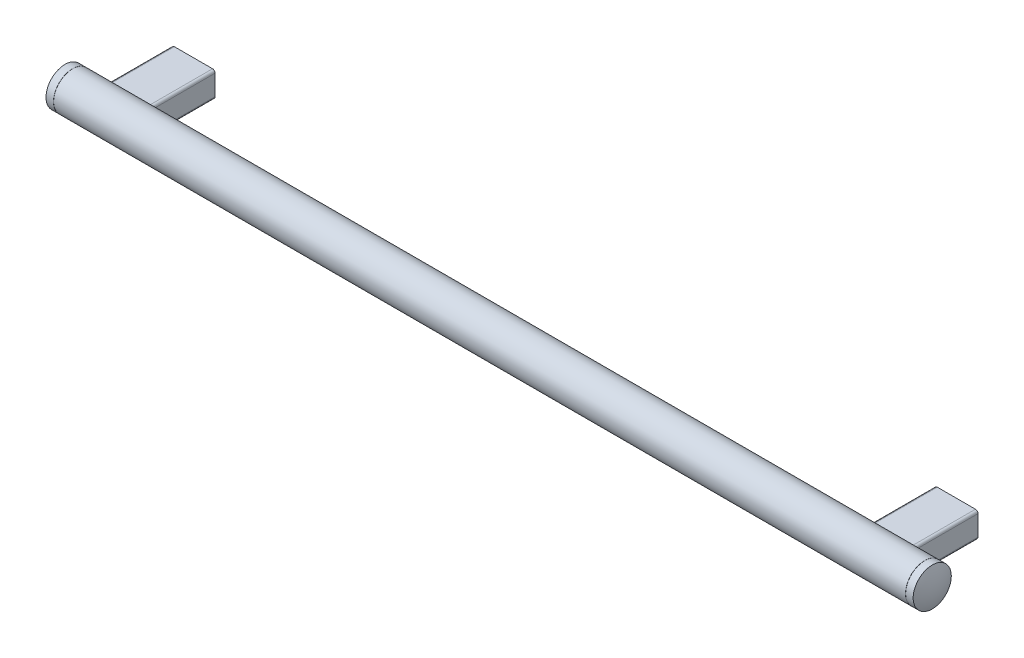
ISO-10303-21;
HEADER;
FILE_DESCRIPTION(('STEP AP214'),'2;1');
FILE_NAME('part.step','',(''),(''),'','','');
FILE_SCHEMA(('AUTOMOTIVE_DESIGN { 1 0 10303 214 1 1 1 1 }'));
ENDSEC;
DATA;
#1=APPLICATION_CONTEXT('core data for automotive mechanical design processes');
#2=APPLICATION_PROTOCOL_DEFINITION('international standard','automotive_design',2000,#1);
#3=PRODUCT_CONTEXT('',#1,'mechanical');
#4=PRODUCT('Part','Part','',(#3));
#5=PRODUCT_RELATED_PRODUCT_CATEGORY('part','',(#4));
#6=PRODUCT_DEFINITION_FORMATION('','',#4);
#7=PRODUCT_DEFINITION_CONTEXT('part definition',#1,'design');
#8=PRODUCT_DEFINITION('design','',#6,#7);
#9=PRODUCT_DEFINITION_SHAPE('','',#8);
#10=(LENGTH_UNIT() NAMED_UNIT(*) SI_UNIT(.MILLI.,.METRE.));
#11=(NAMED_UNIT(*) PLANE_ANGLE_UNIT() SI_UNIT($,.RADIAN.));
#12=(NAMED_UNIT(*) SI_UNIT($,.STERADIAN.) SOLID_ANGLE_UNIT());
#13=UNCERTAINTY_MEASURE_WITH_UNIT(LENGTH_MEASURE(1.E-05),#10,'distance_accuracy_value','');
#14=(GEOMETRIC_REPRESENTATION_CONTEXT(3) GLOBAL_UNCERTAINTY_ASSIGNED_CONTEXT((#13)) GLOBAL_UNIT_ASSIGNED_CONTEXT((#10,
#11,#12)) REPRESENTATION_CONTEXT('',''));
#15=CARTESIAN_POINT('',(0.,0.,0.));
#16=DIRECTION('',(0.,0.,1.));
#17=DIRECTION('',(1.,0.,0.));
#18=AXIS2_PLACEMENT_3D('',#15,#16,#17);
#19=CARTESIAN_POINT('',(0.,0.,17.));
#20=DIRECTION('',(0.,0.,-1.));
#21=DIRECTION('',(0.,1.,0.));
#22=AXIS2_PLACEMENT_3D('',#19,#20,#21);
#23=PLANE('',#22);
#24=CARTESIAN_POINT('',(0.,0.,17.));
#25=DIRECTION('',(0.,0.,-1.));
#26=DIRECTION('',(0.,1.,0.));
#27=AXIS2_PLACEMENT_3D('',#24,#25,#26);
#28=CIRCLE('',#27,3.);
#29=CARTESIAN_POINT('',(0.,3.,17.));
#30=VERTEX_POINT('',#29);
#31=EDGE_CURVE('E209',#30,#30,#28,.T.);
#32=ORIENTED_EDGE('',*,*,#31,.T.);
#33=EDGE_LOOP('',(#32));
#34=FACE_BOUND('',#33,.T.);
#35=ADVANCED_FACE('F14',(#34),#23,.T.);
#36=CARTESIAN_POINT('',(-5.,0.,60.));
#37=DIRECTION('',(1.,0.,0.));
#38=DIRECTION('',(0.,0.,1.));
#39=AXIS2_PLACEMENT_3D('',#36,#37,#38);
#40=SPHERICAL_SURFACE('',#39,39.);
#41=CARTESIAN_POINT('',(-41.,-2.69034686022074E-13,60.));
#42=DIRECTION('',(1.,0.,0.));
#43=DIRECTION('',(0.,1.,0.));
#44=AXIS2_PLACEMENT_3D('',#41,#42,#43);
#45=CIRCLE('',#44,15.);
#46=CARTESIAN_POINT('',(-41.0000000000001,14.9999999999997,60.));
#47=VERTEX_POINT('',#46);
#48=EDGE_CURVE('E322',#47,#47,#45,.T.);
#49=ORIENTED_EDGE('',*,*,#48,.F.);
#50=EDGE_LOOP('',(#49));
#51=FACE_BOUND('',#50,.T.);
#52=ADVANCED_FACE('F16',(#51),#40,.T.);
#53=CARTESIAN_POINT('',(0.,0.,17.));
#54=DIRECTION('',(0.,0.,-1.));
#55=DIRECTION('',(0.,1.,0.));
#56=AXIS2_PLACEMENT_3D('',#53,#54,#55);
#57=CYLINDRICAL_SURFACE('',#56,3.);
#58=ORIENTED_EDGE('',*,*,#31,.F.);
#59=EDGE_LOOP('',(#58));
#60=FACE_BOUND('',#59,.T.);
#61=CARTESIAN_POINT('',(0.,0.,0.));
#62=DIRECTION('',(0.,0.,-1.));
#63=DIRECTION('',(0.,1.,0.));
#64=AXIS2_PLACEMENT_3D('',#61,#62,#63);
#65=CIRCLE('',#64,3.);
#66=CARTESIAN_POINT('',(0.,3.,0.));
#67=VERTEX_POINT('',#66);
#68=EDGE_CURVE('E206',#67,#67,#65,.T.);
#69=ORIENTED_EDGE('',*,*,#68,.T.);
#70=EDGE_LOOP('',(#69));
#71=FACE_BOUND('',#70,.T.);
#72=ADVANCED_FACE('F342',(#60,#71),#57,.F.);
#73=CARTESIAN_POINT('',(-35.,-2.27871649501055E-13,60.));
#74=DIRECTION('',(1.,0.,0.));
#75=DIRECTION('',(0.,1.,0.));
#76=AXIS2_PLACEMENT_3D('',#73,#74,#75);
#77=CYLINDRICAL_SURFACE('',#76,15.);
#78=CARTESIAN_POINT('',(-35.1,-2.28557700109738E-13,60.));
#79=DIRECTION('',(-1.,0.,0.));
#80=DIRECTION('',(0.,-1.,0.));
#81=AXIS2_PLACEMENT_3D('',#78,#79,#80);
#82=CIRCLE('',#81,15.);
#83=CARTESIAN_POINT('',(-35.0999999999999,-15.0000000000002,60.));
#84=VERTEX_POINT('',#83);
#85=EDGE_CURVE('E9',#84,#84,#82,.T.);
#86=ORIENTED_EDGE('',*,*,#85,.T.);
#87=EDGE_LOOP('',(#86));
#88=FACE_BOUND('',#87,.T.);
#89=ORIENTED_EDGE('',*,*,#48,.T.);
#90=EDGE_LOOP('',(#89));
#91=FACE_BOUND('',#90,.T.);
#92=ADVANCED_FACE('F332',(#88,#91),#77,.T.);
#93=CARTESIAN_POINT('',(15.,8.0000000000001,0.));
#94=DIRECTION('',(0.,0.,-1.));
#95=DIRECTION('',(1.,0.,0.));
#96=AXIS2_PLACEMENT_3D('',#93,#94,#95);
#97=PLANE('',#96);
#98=ORIENTED_EDGE('',*,*,#68,.F.);
#99=EDGE_LOOP('',(#98));
#100=FACE_BOUND('',#99,.T.);
#101=CARTESIAN_POINT('',(15.,8.0000000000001,0.));
#102=DIRECTION('',(0.,0.,-1.));
#103=DIRECTION('',(1.,0.,0.));
#104=AXIS2_PLACEMENT_3D('',#101,#102,#103);
#105=CIRCLE('',#104,2.);
#106=CARTESIAN_POINT('',(15.,10.,0.));
#107=VERTEX_POINT('',#106);
#108=CARTESIAN_POINT('',(17.,8.00000000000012,0.));
#109=VERTEX_POINT('',#108);
#110=EDGE_CURVE('E212',#107,#109,#105,.T.);
#111=ORIENTED_EDGE('',*,*,#110,.T.);
#112=DIRECTION('',(0.,-1.,0.));
#113=VECTOR('',#112,1.);
#114=CARTESIAN_POINT('',(17.,8.00000000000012,0.));
#115=LINE('',#114,#113);
#116=CARTESIAN_POINT('',(17.,-7.99999999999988,0.));
#117=VERTEX_POINT('',#116);
#118=EDGE_CURVE('E226',#109,#117,#115,.T.);
#119=ORIENTED_EDGE('',*,*,#118,.T.);
#120=CARTESIAN_POINT('',(15.,-7.9999999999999,0.));
#121=DIRECTION('',(0.,0.,-1.));
#122=DIRECTION('',(1.,0.,0.));
#123=AXIS2_PLACEMENT_3D('',#120,#121,#122);
#124=CIRCLE('',#123,2.);
#125=CARTESIAN_POINT('',(15.,-10.,0.));
#126=VERTEX_POINT('',#125);
#127=EDGE_CURVE('E224',#117,#126,#124,.T.);
#128=ORIENTED_EDGE('',*,*,#127,.T.);
#129=DIRECTION('',(-1.,0.,0.));
#130=VECTOR('',#129,1.);
#131=CARTESIAN_POINT('',(15.,-10.,0.));
#132=LINE('',#131,#130);
#133=CARTESIAN_POINT('',(-15.,-10.,0.));
#134=VERTEX_POINT('',#133);
#135=EDGE_CURVE('E222',#126,#134,#132,.T.);
#136=ORIENTED_EDGE('',*,*,#135,.T.);
#137=CARTESIAN_POINT('',(-15.,-8.0000000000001,0.));
#138=DIRECTION('',(0.,0.,-1.));
#139=DIRECTION('',(1.,0.,0.));
#140=AXIS2_PLACEMENT_3D('',#137,#138,#139);
#141=CIRCLE('',#140,2.);
#142=CARTESIAN_POINT('',(-17.,-8.00000000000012,0.));
#143=VERTEX_POINT('',#142);
#144=EDGE_CURVE('E220',#134,#143,#141,.T.);
#145=ORIENTED_EDGE('',*,*,#144,.T.);
#146=DIRECTION('',(0.,1.,0.));
#147=VECTOR('',#146,1.);
#148=CARTESIAN_POINT('',(-17.,-8.00000000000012,0.));
#149=LINE('',#148,#147);
#150=CARTESIAN_POINT('',(-17.,7.99999999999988,0.));
#151=VERTEX_POINT('',#150);
#152=EDGE_CURVE('E218',#143,#151,#149,.T.);
#153=ORIENTED_EDGE('',*,*,#152,.T.);
#154=CARTESIAN_POINT('',(-15.,7.9999999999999,0.));
#155=DIRECTION('',(0.,0.,-1.));
#156=DIRECTION('',(1.,0.,0.));
#157=AXIS2_PLACEMENT_3D('',#154,#155,#156);
#158=CIRCLE('',#157,2.);
#159=CARTESIAN_POINT('',(-15.,10.,0.));
#160=VERTEX_POINT('',#159);
#161=EDGE_CURVE('E216',#151,#160,#158,.T.);
#162=ORIENTED_EDGE('',*,*,#161,.T.);
#163=DIRECTION('',(1.,0.,0.));
#164=VECTOR('',#163,1.);
#165=CARTESIAN_POINT('',(-15.,10.,0.));
#166=LINE('',#165,#164);
#167=EDGE_CURVE('E213',#160,#107,#166,.T.);
#168=ORIENTED_EDGE('',*,*,#167,.T.);
#169=EDGE_LOOP('',(#111,#119,#128,#136,#145,#153,#162,#168));
#170=FACE_BOUND('',#169,.T.);
#171=ADVANCED_FACE('F330',(#100,#170),#97,.T.);
#172=CARTESIAN_POINT('',(-35.,-2.27871649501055E-13,60.));
#173=DIRECTION('',(-1.,0.,0.));
#174=DIRECTION('',(0.,-1.,0.));
#175=AXIS2_PLACEMENT_3D('',#172,#173,#174);
#176=CONICAL_SURFACE('',#175,14.9,0.785398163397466);
#177=ORIENTED_EDGE('',*,*,#85,.F.);
#178=EDGE_LOOP('',(#177));
#179=FACE_BOUND('',#178,.T.);
#180=CARTESIAN_POINT('',(-35.,-2.27871649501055E-13,60.));
#181=DIRECTION('',(-1.,0.,0.));
#182=DIRECTION('',(0.,-1.,0.));
#183=AXIS2_PLACEMENT_3D('',#180,#181,#182);
#184=CIRCLE('',#183,14.9);
#185=CARTESIAN_POINT('',(-34.9999999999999,-14.9000000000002,60.));
#186=VERTEX_POINT('',#185);
#187=EDGE_CURVE('E22',#186,#186,#184,.F.);
#188=ORIENTED_EDGE('',*,*,#187,.F.);
#189=EDGE_LOOP('',(#188));
#190=FACE_BOUND('',#189,.T.);
#191=ADVANCED_FACE('F308',(#179,#190),#176,.T.);
#192=CARTESIAN_POINT('',(15.,-7.9999999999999,0.));
#193=DIRECTION('',(0.,0.,1.));
#194=DIRECTION('',(-1.,0.,0.));
#195=AXIS2_PLACEMENT_3D('',#192,#193,#194);
#196=CYLINDRICAL_SURFACE('',#195,2.);
#197=CARTESIAN_POINT('',(13.,-7.99999999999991,47.3114224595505));
#198=CARTESIAN_POINT('',(13.0000023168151,-8.14386139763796,47.4021308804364));
#199=CARTESIAN_POINT('',(13.0155259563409,-8.28625788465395,47.4953643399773));
#200=CARTESIAN_POINT('',(13.0758229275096,-8.56371074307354,47.6837058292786));
#201=CARTESIAN_POINT('',(13.1206564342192,-8.69875139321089,47.7788173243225));
#202=CARTESIAN_POINT('',(13.2349554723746,-8.95003632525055,47.9617438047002));
#203=CARTESIAN_POINT('',(13.3028588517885,-9.06691465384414,48.0496641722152));
#204=CARTESIAN_POINT('',(13.4631357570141,-9.28706267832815,48.2199435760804));
#205=CARTESIAN_POINT('',(13.5554607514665,-9.39035876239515,48.3023132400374));
#206=CARTESIAN_POINT('',(13.7336841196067,-9.55123394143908,48.4336095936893));
#207=CARTESIAN_POINT('',(13.8135167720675,-9.6133331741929,48.4852566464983));
#208=CARTESIAN_POINT('',(13.9850088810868,-9.72635405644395,48.5805658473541));
#209=CARTESIAN_POINT('',(14.0766503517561,-9.77729239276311,48.624239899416));
#210=CARTESIAN_POINT('',(14.2529034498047,-9.85726234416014,48.6935123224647));
#211=CARTESIAN_POINT('',(14.3357376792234,-9.88859638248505,48.720955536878));
#212=CARTESIAN_POINT('',(14.507188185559,-9.94039558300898,48.766579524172));
#213=CARTESIAN_POINT('',(14.5958003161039,-9.96086844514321,48.7847668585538));
#214=CARTESIAN_POINT('',(14.7770635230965,-9.98966321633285,48.8104058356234));
#215=CARTESIAN_POINT('',(14.8697344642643,-9.9979163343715,48.8177966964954));
#216=CARTESIAN_POINT('',(15.0555138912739,-10.0013851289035,48.8208987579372));
#217=CARTESIAN_POINT('',(15.1486222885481,-9.99660333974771,48.8166122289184));
#218=CARTESIAN_POINT('',(15.3236977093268,-9.97542143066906,48.7977175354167));
#219=CARTESIAN_POINT('',(15.4059092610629,-9.96011451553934,48.7840808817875));
#220=CARTESIAN_POINT('',(15.5660895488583,-9.91999093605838,48.7485782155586));
#221=CARTESIAN_POINT('',(15.6440574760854,-9.89517246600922,48.7267106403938));
#222=CARTESIAN_POINT('',(15.7999821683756,-9.83508027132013,48.674237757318));
#223=CARTESIAN_POINT('',(15.8775130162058,-9.79916985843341,48.6431064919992));
#224=CARTESIAN_POINT('',(16.0253011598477,-9.71925283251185,48.5746377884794));
#225=CARTESIAN_POINT('',(16.0955525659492,-9.67523974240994,48.5372953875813));
#226=CARTESIAN_POINT('',(16.2620749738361,-9.55636990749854,48.4378021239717));
#227=CARTESIAN_POINT('',(16.353495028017,-9.47718432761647,48.3726678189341));
#228=CARTESIAN_POINT('',(16.518627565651,-9.30686163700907,48.2358889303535));
#229=CARTESIAN_POINT('',(16.5923103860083,-9.21570489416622,48.1642337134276));
#230=CARTESIAN_POINT('',(16.7227715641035,-9.02265032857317,48.0163959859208));
#231=CARTESIAN_POINT('',(16.7792895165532,-8.9206160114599,47.940162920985));
#232=CARTESIAN_POINT('',(16.8736458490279,-8.70912728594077,47.7865564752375));
#233=CARTESIAN_POINT('',(16.9114866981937,-8.5996738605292,47.7091832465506));
#234=CARTESIAN_POINT('',(16.9722292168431,-8.35796248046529,47.543311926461));
#235=CARTESIAN_POINT('',(16.9919212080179,-8.22479320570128,47.4549411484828));
#236=CARTESIAN_POINT('',(17.0040509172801,-7.95466925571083,47.2819435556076));
#237=CARTESIAN_POINT('',(16.9964773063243,-7.81771303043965,47.1973183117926));
#238=CARTESIAN_POINT('',(16.9529013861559,-7.5479211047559,47.0364770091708));
#239=CARTESIAN_POINT('',(16.9176078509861,-7.4150673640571,46.960104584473));
#240=CARTESIAN_POINT('',(16.8182830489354,-7.15555538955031,46.8159187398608));
#241=CARTESIAN_POINT('',(16.7542827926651,-7.02889063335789,46.7480961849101));
#242=CARTESIAN_POINT('',(16.6077870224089,-6.80389422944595,46.631341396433));
#243=CARTESIAN_POINT('',(16.5287203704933,-6.70401274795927,46.5811018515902));
#244=CARTESIAN_POINT('',(16.3502883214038,-6.51906286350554,46.4902837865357));
#245=CARTESIAN_POINT('',(16.2509443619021,-6.43397899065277,46.449695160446));
#246=CARTESIAN_POINT('',(16.0496639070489,-6.29378739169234,46.3840743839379));
#247=CARTESIAN_POINT('',(15.9499072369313,-6.23617899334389,46.3576788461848));
#248=CARTESIAN_POINT('',(15.7404007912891,-6.13851290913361,46.3134536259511));
#249=CARTESIAN_POINT('',(15.6306571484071,-6.09844453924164,46.2956187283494));
#250=CARTESIAN_POINT('',(15.4147576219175,-6.04056991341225,46.2700171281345));
#251=CARTESIAN_POINT('',(15.3091262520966,-6.0211242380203,46.2615068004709));
#252=CARTESIAN_POINT('',(15.0957874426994,-5.99942292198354,46.2520156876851));
#253=CARTESIAN_POINT('',(14.9880805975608,-5.99716243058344,46.2510327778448));
#254=CARTESIAN_POINT('',(14.7777746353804,-6.00969461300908,46.2565067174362));
#255=CARTESIAN_POINT('',(14.6751312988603,-6.02387585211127,46.2626968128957));
#256=CARTESIAN_POINT('',(14.4738867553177,-6.06769355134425,46.281994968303));
#257=CARTESIAN_POINT('',(14.3752853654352,-6.09732931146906,46.2951027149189));
#258=CARTESIAN_POINT('',(14.1842523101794,-6.1710398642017,46.3281349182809));
#259=CARTESIAN_POINT('',(14.0918564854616,-6.21519107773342,46.3480954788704));
#260=CARTESIAN_POINT('',(13.9160688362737,-6.3161436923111,46.3945082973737));
#261=CARTESIAN_POINT('',(13.8326780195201,-6.37294650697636,46.4209612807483));
#262=CARTESIAN_POINT('',(13.6732429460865,-6.49982014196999,46.481218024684));
#263=CARTESIAN_POINT('',(13.5976745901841,-6.57035979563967,46.5152909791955));
#264=CARTESIAN_POINT('',(13.4595254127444,-6.72041002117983,46.5894410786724));
#265=CARTESIAN_POINT('',(13.3969495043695,-6.79992396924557,46.6295204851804));
#266=CARTESIAN_POINT('',(13.2808729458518,-6.97225102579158,46.7185142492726));
#267=CARTESIAN_POINT('',(13.2285510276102,-7.06562015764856,46.7678851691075));
#268=CARTESIAN_POINT('',(13.1401606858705,-7.25695759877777,46.8718461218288));
#269=CARTESIAN_POINT('',(13.1040923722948,-7.35492593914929,46.9264361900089));
#270=CARTESIAN_POINT('',(13.0503538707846,-7.54425766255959,47.0348536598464));
#271=CARTESIAN_POINT('',(13.0313508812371,-7.63544968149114,47.08833048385));
#272=CARTESIAN_POINT('',(13.0061708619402,-7.81795534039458,47.1980102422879));
#273=CARTESIAN_POINT('',(12.9999985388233,-7.90926901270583,47.2542141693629));
#274=CARTESIAN_POINT('',(13.,-7.99999999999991,47.3114224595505));
#275=B_SPLINE_CURVE_WITH_KNOTS('',3,(#197,#198,#199,#200,#201,#202,#203,#204,#205,#206,#207,
#208,#209,#210,#211,#212,#213,#214,#215,#216,#217,#218,#219,#220,#221,#222,#223,#224,#225,#226,
#227,#228,#229,#230,#231,#232,#233,#234,#235,#236,#237,#238,#239,#240,#241,#242,#243,#244,#245,
#246,#247,#248,#249,#250,#251,#252,#253,#254,#255,#256,#257,#258,#259,#260,#261,#262,#263,#264,
#265,#266,#267,#268,#269,#270,#271,#272,#273,#274),.UNSPECIFIED.,.T.,.F.,(4,2,2,2,2,2,2,2,2,2,2,
2,2,2,2,2,2,2,2,2,2,2,2,2,2,2,2,2,2,2,2,2,2,2,2,2,2,2,4),(0.,0.50977099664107,1.02059188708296,
1.50208208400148,1.98262254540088,2.32213593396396,2.66113819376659,2.93816857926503,
3.21500230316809,3.4933886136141,3.77172080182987,4.02480636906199,4.27794000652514,
4.54976470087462,4.82180763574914,5.23168501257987,5.6422431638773,6.05875006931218,
6.47520189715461,6.95596901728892,7.43693592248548,7.90599013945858,8.37453887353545,
8.78294034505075,9.19091226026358,9.54354102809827,9.89595470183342,10.2175724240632,
10.5390993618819,10.8490427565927,11.1589721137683,11.4705600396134,11.7821827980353,
12.1073297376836,12.4325994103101,12.7847727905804,13.1369485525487,13.4583347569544,
13.7798388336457),.UNSPECIFIED.);
#276=CARTESIAN_POINT('',(15.,-10.,48.819660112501));
#277=VERTEX_POINT('',#276);
#278=CARTESIAN_POINT('',(17.,-7.99999999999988,47.3114224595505));
#279=VERTEX_POINT('',#278);
#280=EDGE_CURVE('E296',#277,#279,#275,.T.);
#281=ORIENTED_EDGE('',*,*,#280,.F.);
#282=DIRECTION('',(0.,0.,1.));
#283=VECTOR('',#282,1.);
#284=CARTESIAN_POINT('',(15.,-10.,0.));
#285=LINE('',#284,#283);
#286=EDGE_CURVE('E236',#126,#277,#285,.T.);
#287=ORIENTED_EDGE('',*,*,#286,.F.);
#288=ORIENTED_EDGE('',*,*,#127,.F.);
#289=DIRECTION('',(0.,0.,1.));
#290=VECTOR('',#289,1.);
#291=CARTESIAN_POINT('',(17.,-7.99999999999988,0.));
#292=LINE('',#291,#290);
#293=EDGE_CURVE('E233',#117,#279,#292,.T.);
#294=ORIENTED_EDGE('',*,*,#293,.T.);
#295=EDGE_LOOP('',(#281,#287,#288,#294));
#296=FACE_BOUND('',#295,.T.);
#297=ADVANCED_FACE('F304',(#296),#196,.T.);
#298=CARTESIAN_POINT('',(15.,-10.,0.));
#299=DIRECTION('',(0.,1.,0.));
#300=DIRECTION('',(1.,0.,0.));
#301=AXIS2_PLACEMENT_3D('',#298,#299,#300);
#302=PLANE('',#301);
#303=DIRECTION('',(1.,0.,0.));
#304=VECTOR('',#303,1.);
#305=CARTESIAN_POINT('',(-35.,-10.0000000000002,48.819660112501));
#306=LINE('',#305,#304);
#307=CARTESIAN_POINT('',(-15.,-10.,48.8196601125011));
#308=VERTEX_POINT('',#307);
#309=EDGE_CURVE('E293',#308,#277,#306,.T.);
#310=ORIENTED_EDGE('',*,*,#309,.F.);
#311=DIRECTION('',(0.,0.,1.));
#312=VECTOR('',#311,1.);
#313=CARTESIAN_POINT('',(-15.,-10.,0.));
#314=LINE('',#313,#312);
#315=EDGE_CURVE('E239',#134,#308,#314,.T.);
#316=ORIENTED_EDGE('',*,*,#315,.F.);
#317=ORIENTED_EDGE('',*,*,#135,.F.);
#318=ORIENTED_EDGE('',*,*,#286,.T.);
#319=EDGE_LOOP('',(#310,#316,#317,#318));
#320=FACE_BOUND('',#319,.T.);
#321=ADVANCED_FACE('F284',(#320),#302,.F.);
#322=CARTESIAN_POINT('',(-15.,-8.0000000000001,0.));
#323=DIRECTION('',(0.,0.,1.));
#324=DIRECTION('',(-1.,0.,0.));
#325=AXIS2_PLACEMENT_3D('',#322,#323,#324);
#326=CYLINDRICAL_SURFACE('',#325,2.);
#327=CARTESIAN_POINT('',(-17.,-8.00000000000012,47.3114224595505));
#328=CARTESIAN_POINT('',(-16.9999976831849,-8.14386139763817,47.4021308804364));
#329=CARTESIAN_POINT('',(-16.9844740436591,-8.28625788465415,47.4953643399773));
#330=CARTESIAN_POINT('',(-16.9241770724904,-8.56371074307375,47.6837058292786));
#331=CARTESIAN_POINT('',(-16.8793435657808,-8.69875139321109,47.7788173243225));
#332=CARTESIAN_POINT('',(-16.7650445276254,-8.95003632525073,47.9617438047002));
#333=CARTESIAN_POINT('',(-16.6971411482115,-9.06691465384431,48.0496641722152));
#334=CARTESIAN_POINT('',(-16.5368642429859,-9.28706267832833,48.2199435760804));
#335=CARTESIAN_POINT('',(-16.4445392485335,-9.39035876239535,48.3023132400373));
#336=CARTESIAN_POINT('',(-16.2663158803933,-9.55123394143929,48.4336095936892));
#337=CARTESIAN_POINT('',(-16.1864832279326,-9.61333317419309,48.4852566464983));
#338=CARTESIAN_POINT('',(-16.0149911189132,-9.72635405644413,48.5805658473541));
#339=CARTESIAN_POINT('',(-15.9233496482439,-9.77729239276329,48.624239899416));
#340=CARTESIAN_POINT('',(-15.7470965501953,-9.85726234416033,48.6935123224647));
#341=CARTESIAN_POINT('',(-15.6642623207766,-9.88859638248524,48.720955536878));
#342=CARTESIAN_POINT('',(-15.492811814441,-9.94039558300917,48.7665795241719));
#343=CARTESIAN_POINT('',(-15.4041996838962,-9.96086844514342,48.7847668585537));
#344=CARTESIAN_POINT('',(-15.2229364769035,-9.98966321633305,48.8104058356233));
#345=CARTESIAN_POINT('',(-15.1302655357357,-9.9979163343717,48.8177966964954));
#346=CARTESIAN_POINT('',(-14.9444861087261,-10.0013851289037,48.8208987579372));
#347=CARTESIAN_POINT('',(-14.8513777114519,-9.99660333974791,48.8166122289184));
#348=CARTESIAN_POINT('',(-14.6763022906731,-9.97542143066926,48.7977175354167));
#349=CARTESIAN_POINT('',(-14.5940907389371,-9.96011451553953,48.7840808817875));
#350=CARTESIAN_POINT('',(-14.4339104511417,-9.91999093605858,48.7485782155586));
#351=CARTESIAN_POINT('',(-14.3559425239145,-9.89517246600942,48.7267106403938));
#352=CARTESIAN_POINT('',(-14.2000178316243,-9.83508027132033,48.674237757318));
#353=CARTESIAN_POINT('',(-14.1224869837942,-9.7991698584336,48.6431064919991));
#354=CARTESIAN_POINT('',(-13.9746988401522,-9.71925283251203,48.5746377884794));
#355=CARTESIAN_POINT('',(-13.9044474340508,-9.67523974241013,48.5372953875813));
#356=CARTESIAN_POINT('',(-13.7379250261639,-9.55636990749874,48.4378021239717));
#357=CARTESIAN_POINT('',(-13.646504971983,-9.47718432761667,48.3726678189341));
#358=CARTESIAN_POINT('',(-13.481372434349,-9.30686163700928,48.2358889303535));
#359=CARTESIAN_POINT('',(-13.4076896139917,-9.21570489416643,48.1642337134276));
#360=CARTESIAN_POINT('',(-13.2772284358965,-9.02265032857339,48.0163959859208));
#361=CARTESIAN_POINT('',(-13.2207104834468,-8.92061601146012,47.9401629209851));
#362=CARTESIAN_POINT('',(-13.1263541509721,-8.70912728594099,47.7865564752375));
#363=CARTESIAN_POINT('',(-13.0885133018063,-8.59967386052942,47.7091832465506));
#364=CARTESIAN_POINT('',(-13.0277707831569,-8.35796248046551,47.543311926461));
#365=CARTESIAN_POINT('',(-13.0080787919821,-8.2247932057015,47.4549411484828));
#366=CARTESIAN_POINT('',(-12.9959490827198,-7.95466925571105,47.2819435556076));
#367=CARTESIAN_POINT('',(-13.0035226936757,-7.81771303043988,47.1973183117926));
#368=CARTESIAN_POINT('',(-13.0470986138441,-7.54792110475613,47.0364770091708));
#369=CARTESIAN_POINT('',(-13.0823921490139,-7.41506736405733,46.960104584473));
#370=CARTESIAN_POINT('',(-13.1817169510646,-7.15555538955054,46.8159187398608));
#371=CARTESIAN_POINT('',(-13.2457172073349,-7.02889063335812,46.7480961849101));
#372=CARTESIAN_POINT('',(-13.392212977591,-6.80389422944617,46.631341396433));
#373=CARTESIAN_POINT('',(-13.4712796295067,-6.70401274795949,46.5811018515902));
#374=CARTESIAN_POINT('',(-13.6497116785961,-6.51906286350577,46.4902837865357));
#375=CARTESIAN_POINT('',(-13.7490556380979,-6.433978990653,46.449695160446));
#376=CARTESIAN_POINT('',(-13.950336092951,-6.29378739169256,46.3840743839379));
#377=CARTESIAN_POINT('',(-14.0500927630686,-6.23617899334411,46.3576788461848));
#378=CARTESIAN_POINT('',(-14.2595992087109,-6.13851290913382,46.3134536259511));
#379=CARTESIAN_POINT('',(-14.3693428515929,-6.09844453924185,46.2956187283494));
#380=CARTESIAN_POINT('',(-14.5852423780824,-6.04056991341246,46.2700171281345));
#381=CARTESIAN_POINT('',(-14.6908737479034,-6.02112423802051,46.2615068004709));
#382=CARTESIAN_POINT('',(-14.9042125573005,-5.99942292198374,46.2520156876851));
#383=CARTESIAN_POINT('',(-15.0119194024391,-5.99716243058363,46.2510327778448));
#384=CARTESIAN_POINT('',(-15.2222253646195,-6.00969461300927,46.2565067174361));
#385=CARTESIAN_POINT('',(-15.3248687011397,-6.02387585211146,46.2626968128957));
#386=CARTESIAN_POINT('',(-15.5261132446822,-6.06769355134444,46.281994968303));
#387=CARTESIAN_POINT('',(-15.6247146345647,-6.09732931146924,46.2951027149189));
#388=CARTESIAN_POINT('',(-15.8157476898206,-6.17103986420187,46.3281349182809));
#389=CARTESIAN_POINT('',(-15.9081435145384,-6.21519107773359,46.3480954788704));
#390=CARTESIAN_POINT('',(-16.0839311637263,-6.31614369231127,46.3945082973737));
#391=CARTESIAN_POINT('',(-16.1673219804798,-6.37294650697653,46.4209612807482));
#392=CARTESIAN_POINT('',(-16.3267570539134,-6.49982014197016,46.4812180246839));
#393=CARTESIAN_POINT('',(-16.4023254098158,-6.57035979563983,46.5152909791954));
#394=CARTESIAN_POINT('',(-16.5404745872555,-6.72041002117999,46.5894410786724));
#395=CARTESIAN_POINT('',(-16.6030504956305,-6.79992396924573,46.6295204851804));
#396=CARTESIAN_POINT('',(-16.7191270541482,-6.97225102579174,46.7185142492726));
#397=CARTESIAN_POINT('',(-16.7714489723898,-7.06562015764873,46.7678851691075));
#398=CARTESIAN_POINT('',(-16.8598393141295,-7.25695759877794,46.8718461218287));
#399=CARTESIAN_POINT('',(-16.8959076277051,-7.35492593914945,46.9264361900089));
#400=CARTESIAN_POINT('',(-16.9496461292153,-7.54425766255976,47.0348536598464));
#401=CARTESIAN_POINT('',(-16.9686491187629,-7.63544968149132,47.08833048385));
#402=CARTESIAN_POINT('',(-16.9938291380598,-7.81795534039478,47.1980102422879));
#403=CARTESIAN_POINT('',(-17.0000014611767,-7.90926901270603,47.2542141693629));
#404=CARTESIAN_POINT('',(-17.,-8.00000000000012,47.3114224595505));
#405=B_SPLINE_CURVE_WITH_KNOTS('',3,(#327,#328,#329,#330,#331,#332,#333,#334,#335,#336,#337,
#338,#339,#340,#341,#342,#343,#344,#345,#346,#347,#348,#349,#350,#351,#352,#353,#354,#355,#356,
#357,#358,#359,#360,#361,#362,#363,#364,#365,#366,#367,#368,#369,#370,#371,#372,#373,#374,#375,
#376,#377,#378,#379,#380,#381,#382,#383,#384,#385,#386,#387,#388,#389,#390,#391,#392,#393,#394,
#395,#396,#397,#398,#399,#400,#401,#402,#403,#404),.UNSPECIFIED.,.T.,.F.,(4,2,2,2,2,2,2,2,2,2,2,
2,2,2,2,2,2,2,2,2,2,2,2,2,2,2,2,2,2,2,2,2,2,2,2,2,2,2,4),(0.,0.509770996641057,1.02059188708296,
1.50208208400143,1.98262254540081,2.32213593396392,2.66113819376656,2.93816857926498,
3.21500230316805,3.49338861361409,3.77172080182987,4.024806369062,4.27794000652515,
4.54976470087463,4.82180763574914,5.23168501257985,5.64224316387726,6.05875006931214,
6.47520189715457,6.95596901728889,7.43693592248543,7.90599013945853,8.37453887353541,
8.78294034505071,9.19091226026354,9.54354102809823,9.89595470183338,10.2175724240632,
10.5390993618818,10.8490427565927,11.1589721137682,11.4705600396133,11.7821827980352,
12.1073297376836,12.4325994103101,12.7847727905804,13.1369485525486,13.4583347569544,
13.7798388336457),.UNSPECIFIED.);
#406=CARTESIAN_POINT('',(-17.,-8.00000000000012,47.3114224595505));
#407=VERTEX_POINT('',#406);
#408=EDGE_CURVE('E287',#407,#308,#405,.T.);
#409=ORIENTED_EDGE('',*,*,#408,.F.);
#410=DIRECTION('',(0.,0.,1.));
#411=VECTOR('',#410,1.);
#412=CARTESIAN_POINT('',(-17.,-8.00000000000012,0.));
#413=LINE('',#412,#411);
#414=EDGE_CURVE('E242',#143,#407,#413,.T.);
#415=ORIENTED_EDGE('',*,*,#414,.F.);
#416=ORIENTED_EDGE('',*,*,#144,.F.);
#417=ORIENTED_EDGE('',*,*,#315,.T.);
#418=EDGE_LOOP('',(#409,#415,#416,#417));
#419=FACE_BOUND('',#418,.T.);
#420=ADVANCED_FACE('F279',(#419),#326,.T.);
#421=CARTESIAN_POINT('',(-17.,-8.00000000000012,0.));
#422=DIRECTION('',(1.,0.,0.));
#423=DIRECTION('',(0.,0.,1.));
#424=AXIS2_PLACEMENT_3D('',#421,#422,#423);
#425=PLANE('',#424);
#426=CARTESIAN_POINT('',(-17.,-1.18710434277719E-13,60.));
#427=DIRECTION('',(1.,0.,0.));
#428=DIRECTION('',(0.,0.,1.));
#429=AXIS2_PLACEMENT_3D('',#426,#427,#428);
#430=CIRCLE('',#429,15.);
#431=CARTESIAN_POINT('',(-17.,7.99999999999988,47.3114224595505));
#432=VERTEX_POINT('',#431);
#433=EDGE_CURVE('E263',#432,#407,#430,.F.);
#434=ORIENTED_EDGE('',*,*,#433,.F.);
#435=DIRECTION('',(0.,0.,1.));
#436=VECTOR('',#435,1.);
#437=CARTESIAN_POINT('',(-17.,7.99999999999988,0.));
#438=LINE('',#437,#436);
#439=EDGE_CURVE('E245',#151,#432,#438,.T.);
#440=ORIENTED_EDGE('',*,*,#439,.F.);
#441=ORIENTED_EDGE('',*,*,#152,.F.);
#442=ORIENTED_EDGE('',*,*,#414,.T.);
#443=EDGE_LOOP('',(#434,#440,#441,#442));
#444=FACE_BOUND('',#443,.T.);
#445=ADVANCED_FACE('F274',(#444),#425,.F.);
#446=CARTESIAN_POINT('',(-15.,7.9999999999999,0.));
#447=DIRECTION('',(0.,0.,1.));
#448=DIRECTION('',(-1.,0.,0.));
#449=AXIS2_PLACEMENT_3D('',#446,#447,#448);
#450=CYLINDRICAL_SURFACE('',#449,2.);
#451=CARTESIAN_POINT('',(-17.,7.99999999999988,47.3114224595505));
#452=CARTESIAN_POINT('',(-16.9999991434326,7.87909476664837,47.2351918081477));
#453=CARTESIAN_POINT('',(-16.9890388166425,7.75708923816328,47.1607041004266));
#454=CARTESIAN_POINT('',(-16.944013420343,7.51414460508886,47.0170299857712));
#455=CARTESIAN_POINT('',(-16.909954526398,7.39320522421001,46.9478421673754));
#456=CARTESIAN_POINT('',(-16.8175938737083,7.15580080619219,46.8161820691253));
#457=CARTESIAN_POINT('',(-16.7591388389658,7.03936923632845,46.7537554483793));
#458=CARTESIAN_POINT('',(-16.6180104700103,6.81706769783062,46.6379910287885));
#459=CARTESIAN_POINT('',(-16.5353548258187,6.71119009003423,46.5846466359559));
#460=CARTESIAN_POINT('',(-16.3589136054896,6.52774525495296,46.4945296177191));
#461=CARTESIAN_POINT('',(-16.2677073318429,6.44830074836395,46.4565302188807));
#462=CARTESIAN_POINT('',(-16.0701948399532,6.30605393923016,46.3897143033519));
#463=CARTESIAN_POINT('',(-15.9639012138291,6.24323788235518,46.3608901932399));
#464=CARTESIAN_POINT('',(-15.7525224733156,6.14371866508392,46.3157983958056));
#465=CARTESIAN_POINT('',(-15.6486727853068,6.10485920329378,46.298476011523));
#466=CARTESIAN_POINT('',(-15.4350253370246,6.04473842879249,46.2718452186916));
#467=CARTESIAN_POINT('',(-15.3252301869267,6.02346945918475,46.2625333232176));
#468=CARTESIAN_POINT('',(-15.1101174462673,6.00028628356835,46.2523925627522));
#469=CARTESIAN_POINT('',(-15.0049409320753,5.99726003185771,46.2510762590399));
#470=CARTESIAN_POINT('',(-14.795579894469,6.00771705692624,46.2556422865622));
#471=CARTESIAN_POINT('',(-14.6913952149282,6.02119769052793,46.2615234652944));
#472=CARTESIAN_POINT('',(-14.4886277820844,6.06374928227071,46.2802526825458));
#473=CARTESIAN_POINT('',(-14.3899832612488,6.09257556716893,46.2929914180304));
#474=CARTESIAN_POINT('',(-14.1992155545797,6.16447906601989,46.3251786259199));
#475=CARTESIAN_POINT('',(-14.1070926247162,6.20755683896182,46.3446273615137));
#476=CARTESIAN_POINT('',(-13.9295504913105,6.30744168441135,46.3904718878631));
#477=CARTESIAN_POINT('',(-13.8443382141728,6.36454602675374,46.417019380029));
#478=CARTESIAN_POINT('',(-13.6849200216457,6.48975291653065,46.4763947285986));
#479=CARTESIAN_POINT('',(-13.6107163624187,6.55785771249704,46.5092238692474));
#480=CARTESIAN_POINT('',(-13.4703450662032,6.7072135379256,46.5828236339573));
#481=CARTESIAN_POINT('',(-13.4049591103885,6.78901734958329,46.6239600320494));
#482=CARTESIAN_POINT('',(-13.288789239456,6.95960528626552,46.7119184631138));
#483=CARTESIAN_POINT('',(-13.2380106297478,7.04839193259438,46.7587425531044));
#484=CARTESIAN_POINT('',(-13.146904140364,7.23951560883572,46.8621785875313));
#485=CARTESIAN_POINT('',(-13.1081365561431,7.34231828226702,46.9193012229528));
#486=CARTESIAN_POINT('',(-13.0482089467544,7.55028832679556,47.0382283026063));
#487=CARTESIAN_POINT('',(-13.0270567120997,7.65545672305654,47.1000348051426));
#488=CARTESIAN_POINT('',(-13.0000866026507,7.87914859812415,47.2352758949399));
#489=CARTESIAN_POINT('',(-12.9965732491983,7.9976616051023,47.309187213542));
#490=CARTESIAN_POINT('',(-13.0100119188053,8.23176813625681,47.459768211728));
#491=CARTESIAN_POINT('',(-13.026978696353,8.34735949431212,47.5364398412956));
#492=CARTESIAN_POINT('',(-13.0835973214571,8.5867568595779,47.6999585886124));
#493=CARTESIAN_POINT('',(-13.1257113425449,8.70990049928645,47.786929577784));
#494=CARTESIAN_POINT('',(-13.2334577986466,8.9467076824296,47.9593245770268));
#495=CARTESIAN_POINT('',(-13.2990930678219,9.06037008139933,48.0447483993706));
#496=CARTESIAN_POINT('',(-13.4423655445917,9.25960123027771,48.1985889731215));
#497=CARTESIAN_POINT('',(-13.5169227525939,9.34685994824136,48.2676856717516));
#498=CARTESIAN_POINT('',(-13.6829377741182,9.50957472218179,48.3991861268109));
#499=CARTESIAN_POINT('',(-13.7743716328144,9.58504723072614,48.4615991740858));
#500=CARTESIAN_POINT('',(-13.9509067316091,9.70530243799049,48.5627005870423));
#501=CARTESIAN_POINT('',(-14.0326722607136,9.75315622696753,48.603550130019));
#502=CARTESIAN_POINT('',(-14.2053049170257,9.83784302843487,48.6765742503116));
#503=CARTESIAN_POINT('',(-14.296160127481,9.87469022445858,48.7087599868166));
#504=CARTESIAN_POINT('',(-14.4712701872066,9.9306990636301,48.758007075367));
#505=CARTESIAN_POINT('',(-14.554509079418,9.95167197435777,48.7766025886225));
#506=CARTESIAN_POINT('',(-14.7245244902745,9.98281750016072,48.8042955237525));
#507=CARTESIAN_POINT('',(-14.8112988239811,9.99299668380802,48.8133987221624));
#508=CARTESIAN_POINT('',(-14.9861247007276,10.0018703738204,48.8213315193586));
#509=CARTESIAN_POINT('',(-15.0741788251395,10.0005370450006,48.8201362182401));
#510=CARTESIAN_POINT('',(-15.2486141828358,9.98641726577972,48.8075224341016));
#511=CARTESIAN_POINT('',(-15.3349950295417,9.97362820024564,48.7961016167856));
#512=CARTESIAN_POINT('',(-15.5009447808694,9.93804813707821,48.7645323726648));
#513=CARTESIAN_POINT('',(-15.5806434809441,9.91559258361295,48.7446769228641));
#514=CARTESIAN_POINT('',(-15.7347280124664,9.86194601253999,48.6976421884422));
#515=CARTESIAN_POINT('',(-15.8091112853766,9.83075082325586,48.6704594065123));
#516=CARTESIAN_POINT('',(-15.9806238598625,9.74666189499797,48.5979492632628));
#517=CARTESIAN_POINT('',(-16.0747398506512,9.69009939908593,48.5497345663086));
#518=CARTESIAN_POINT('',(-16.2497262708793,9.56518206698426,48.4451760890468));
#519=CARTESIAN_POINT('',(-16.3305694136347,9.49680351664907,48.3888159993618));
#520=CARTESIAN_POINT('',(-16.497930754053,9.331678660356,48.2554817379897));
#521=CARTESIAN_POINT('',(-16.5804869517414,9.23217372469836,48.1769512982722));
#522=CARTESIAN_POINT('',(-16.7240153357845,9.02177052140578,48.0156229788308));
#523=CARTESIAN_POINT('',(-16.7849693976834,8.9108627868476,47.932821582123));
#524=CARTESIAN_POINT('',(-16.8890292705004,8.67085776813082,47.7590885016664));
#525=CARTESIAN_POINT('',(-16.9302441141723,8.54101472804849,47.6680503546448));
#526=CARTESIAN_POINT('',(-16.9857218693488,8.27458961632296,47.4877259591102));
#527=CARTESIAN_POINT('',(-17.0000009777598,8.13801164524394,47.3984386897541));
#528=CARTESIAN_POINT('',(-17.,7.99999999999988,47.3114224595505));
#529=B_SPLINE_CURVE_WITH_KNOTS('',3,(#451,#452,#453,#454,#455,#456,#457,#458,#459,#460,#461,
#462,#463,#464,#465,#466,#467,#468,#469,#470,#471,#472,#473,#474,#475,#476,#477,#478,#479,#480,
#481,#482,#483,#484,#485,#486,#487,#488,#489,#490,#491,#492,#493,#494,#495,#496,#497,#498,#499,
#500,#501,#502,#503,#504,#505,#506,#507,#508,#509,#510,#511,#512,#513,#514,#515,#516,#517,#518,
#519,#520,#521,#522,#523,#524,#525,#526,#527,#528),.UNSPECIFIED.,.T.,.F.,(4,2,2,2,2,2,2,2,2,2,2,
2,2,2,2,2,2,2,2,2,2,2,2,2,2,2,2,2,2,2,2,2,2,2,2,2,2,2,4),(0.,0.428302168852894,
0.856489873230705,1.28740928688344,1.71801449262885,2.09620696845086,2.47408563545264,
2.80902084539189,3.14381018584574,3.45796652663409,3.77207256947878,4.08131419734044,
4.39056795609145,4.70704747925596,5.02359177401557,5.35972890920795,5.69598797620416,
6.06599418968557,6.43616395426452,6.85362917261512,7.27139532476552,7.73894100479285,
8.206543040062,8.60695107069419,9.00679507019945,9.31517612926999,9.6231580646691,
9.88551744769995,10.1477170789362,10.4105508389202,10.6734446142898,10.9278702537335,
11.1824175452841,11.5402241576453,11.8987573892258,12.3502378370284,12.8020961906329,
13.2912914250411,13.7801924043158),.UNSPECIFIED.);
#530=CARTESIAN_POINT('',(-15.,10.,48.8196601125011));
#531=VERTEX_POINT('',#530);
#532=EDGE_CURVE('E255',#531,#432,#529,.T.);
#533=ORIENTED_EDGE('',*,*,#532,.F.);
#534=DIRECTION('',(0.,0.,1.));
#535=VECTOR('',#534,1.);
#536=CARTESIAN_POINT('',(-15.,10.,0.));
#537=LINE('',#536,#535);
#538=EDGE_CURVE('E29',#160,#531,#537,.T.);
#539=ORIENTED_EDGE('',*,*,#538,.F.);
#540=ORIENTED_EDGE('',*,*,#161,.F.);
#541=ORIENTED_EDGE('',*,*,#439,.T.);
#542=EDGE_LOOP('',(#533,#539,#540,#541));
#543=FACE_BOUND('',#542,.T.);
#544=ADVANCED_FACE('F268',(#543),#450,.T.);
#545=CARTESIAN_POINT('',(-15.,10.,0.));
#546=DIRECTION('',(0.,-1.,0.));
#547=DIRECTION('',(-1.,0.,0.));
#548=AXIS2_PLACEMENT_3D('',#545,#546,#547);
#549=PLANE('',#548);
#550=DIRECTION('',(1.,0.,0.));
#551=VECTOR('',#550,1.);
#552=CARTESIAN_POINT('',(-35.,9.99999999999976,48.8196601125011));
#553=LINE('',#552,#551);
#554=CARTESIAN_POINT('',(15.,10.,48.8196601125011));
#555=VERTEX_POINT('',#554);
#556=EDGE_CURVE('E252',#555,#531,#553,.F.);
#557=ORIENTED_EDGE('',*,*,#556,.F.);
#558=DIRECTION('',(0.,0.,1.));
#559=VECTOR('',#558,1.);
#560=CARTESIAN_POINT('',(15.,10.,0.));
#561=LINE('',#560,#559);
#562=EDGE_CURVE('E215',#107,#555,#561,.T.);
#563=ORIENTED_EDGE('',*,*,#562,.F.);
#564=ORIENTED_EDGE('',*,*,#167,.F.);
#565=ORIENTED_EDGE('',*,*,#538,.T.);
#566=EDGE_LOOP('',(#557,#563,#564,#565));
#567=FACE_BOUND('',#566,.T.);
#568=ADVANCED_FACE('F273',(#567),#549,.F.);
#569=CARTESIAN_POINT('',(15.,8.0000000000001,0.));
#570=DIRECTION('',(0.,0.,1.));
#571=DIRECTION('',(-1.,0.,0.));
#572=AXIS2_PLACEMENT_3D('',#569,#570,#571);
#573=CYLINDRICAL_SURFACE('',#572,2.);
#574=CARTESIAN_POINT('',(13.,8.00000000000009,47.3114224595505));
#575=CARTESIAN_POINT('',(13.0000008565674,7.87909476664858,47.2351918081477));
#576=CARTESIAN_POINT('',(13.0109611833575,7.75708923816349,47.1607041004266));
#577=CARTESIAN_POINT('',(13.055986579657,7.51414460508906,47.0170299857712));
#578=CARTESIAN_POINT('',(13.090045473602,7.39320522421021,46.9478421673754));
#579=CARTESIAN_POINT('',(13.1824061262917,7.15580080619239,46.8161820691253));
#580=CARTESIAN_POINT('',(13.2408611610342,7.03936923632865,46.7537554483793));
#581=CARTESIAN_POINT('',(13.3819895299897,6.81706769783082,46.6379910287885));
#582=CARTESIAN_POINT('',(13.4646451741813,6.71119009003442,46.5846466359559));
#583=CARTESIAN_POINT('',(13.6410863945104,6.52774525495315,46.4945296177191));
#584=CARTESIAN_POINT('',(13.7322926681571,6.44830074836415,46.4565302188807));
#585=CARTESIAN_POINT('',(13.9298051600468,6.30605393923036,46.3897143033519));
#586=CARTESIAN_POINT('',(14.0360987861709,6.24323788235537,46.3608901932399));
#587=CARTESIAN_POINT('',(14.2474775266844,6.14371866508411,46.3157983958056));
#588=CARTESIAN_POINT('',(14.3513272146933,6.10485920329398,46.298476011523));
#589=CARTESIAN_POINT('',(14.5649746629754,6.04473842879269,46.2718452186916));
#590=CARTESIAN_POINT('',(14.6747698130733,6.02346945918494,46.2625333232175));
#591=CARTESIAN_POINT('',(14.8898825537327,6.00028628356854,46.2523925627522));
#592=CARTESIAN_POINT('',(14.9950590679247,5.99726003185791,46.2510762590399));
#593=CARTESIAN_POINT('',(15.204420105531,6.00771705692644,46.2556422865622));
#594=CARTESIAN_POINT('',(15.3086047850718,6.02119769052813,46.2615234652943));
#595=CARTESIAN_POINT('',(15.5113722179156,6.06374928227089,46.2802526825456));
#596=CARTESIAN_POINT('',(15.6100167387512,6.09257556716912,46.2929914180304));
#597=CARTESIAN_POINT('',(15.8007844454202,6.16447906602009,46.3251786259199));
#598=CARTESIAN_POINT('',(15.8929073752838,6.20755683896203,46.3446273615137));
#599=CARTESIAN_POINT('',(16.0704495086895,6.30744168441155,46.3904718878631));
#600=CARTESIAN_POINT('',(16.1556617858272,6.36454602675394,46.417019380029));
#601=CARTESIAN_POINT('',(16.3150799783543,6.48975291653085,46.4763947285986));
#602=CARTESIAN_POINT('',(16.3892836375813,6.55785771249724,46.5092238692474));
#603=CARTESIAN_POINT('',(16.5296549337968,6.7072135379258,46.5828236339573));
#604=CARTESIAN_POINT('',(16.5950408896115,6.78901734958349,46.6239600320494));
#605=CARTESIAN_POINT('',(16.711210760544,6.95960528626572,46.7119184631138));
#606=CARTESIAN_POINT('',(16.7619893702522,7.04839193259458,46.7587425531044));
#607=CARTESIAN_POINT('',(16.853095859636,7.23951560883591,46.8621785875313));
#608=CARTESIAN_POINT('',(16.8918634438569,7.34231828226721,46.9193012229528));
#609=CARTESIAN_POINT('',(16.9517910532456,7.55028832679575,47.0382283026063));
#610=CARTESIAN_POINT('',(16.9729432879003,7.65545672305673,47.1000348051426));
#611=CARTESIAN_POINT('',(16.9999133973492,7.87914859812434,47.23527589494));
#612=CARTESIAN_POINT('',(17.0034267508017,7.9976616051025,47.309187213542));
#613=CARTESIAN_POINT('',(16.9899880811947,8.23176813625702,47.4597682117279));
#614=CARTESIAN_POINT('',(16.9730213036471,8.34735949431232,47.5364398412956));
#615=CARTESIAN_POINT('',(16.9164026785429,8.5867568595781,47.6999585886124));
#616=CARTESIAN_POINT('',(16.8742886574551,8.70990049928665,47.786929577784));
#617=CARTESIAN_POINT('',(16.7665422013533,8.94670768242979,47.9593245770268));
#618=CARTESIAN_POINT('',(16.7009069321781,9.06037008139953,48.0447483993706));
#619=CARTESIAN_POINT('',(16.5576344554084,9.2596012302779,48.1985889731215));
#620=CARTESIAN_POINT('',(16.4830772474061,9.34685994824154,48.2676856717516));
#621=CARTESIAN_POINT('',(16.3170622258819,9.50957472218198,48.3991861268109));
#622=CARTESIAN_POINT('',(16.2256283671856,9.58504723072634,48.4615991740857));
#623=CARTESIAN_POINT('',(16.0490932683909,9.7053024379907,48.5627005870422));
#624=CARTESIAN_POINT('',(15.9673277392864,9.75315622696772,48.603550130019));
#625=CARTESIAN_POINT('',(15.7946950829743,9.83784302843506,48.6765742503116));
#626=CARTESIAN_POINT('',(15.7038398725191,9.87469022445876,48.7087599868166));
#627=CARTESIAN_POINT('',(15.5287298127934,9.93069906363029,48.758007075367));
#628=CARTESIAN_POINT('',(15.445490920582,9.95167197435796,48.7766025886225));
#629=CARTESIAN_POINT('',(15.2754755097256,9.98281750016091,48.8042955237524));
#630=CARTESIAN_POINT('',(15.188701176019,9.99299668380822,48.8133987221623));
#631=CARTESIAN_POINT('',(15.0138752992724,10.0018703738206,48.8213315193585));
#632=CARTESIAN_POINT('',(14.9258211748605,10.0005370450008,48.8201362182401));
#633=CARTESIAN_POINT('',(14.7513858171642,9.98641726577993,48.8075224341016));
#634=CARTESIAN_POINT('',(14.6650049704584,9.97362820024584,48.7961016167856));
#635=CARTESIAN_POINT('',(14.4990552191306,9.93804813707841,48.7645323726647));
#636=CARTESIAN_POINT('',(14.4193565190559,9.91559258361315,48.7446769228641));
#637=CARTESIAN_POINT('',(14.2652719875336,9.86194601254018,48.6976421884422));
#638=CARTESIAN_POINT('',(14.1908887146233,9.83075082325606,48.6704594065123));
#639=CARTESIAN_POINT('',(14.0193761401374,9.74666189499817,48.5979492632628));
#640=CARTESIAN_POINT('',(13.9252601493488,9.69009939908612,48.5497345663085));
#641=CARTESIAN_POINT('',(13.7502737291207,9.56518206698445,48.4451760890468));
#642=CARTESIAN_POINT('',(13.6694305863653,9.49680351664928,48.3888159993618));
#643=CARTESIAN_POINT('',(13.5020692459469,9.33167866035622,48.2554817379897));
#644=CARTESIAN_POINT('',(13.4195130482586,9.23217372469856,48.1769512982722));
#645=CARTESIAN_POINT('',(13.2759846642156,9.02177052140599,48.0156229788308));
#646=CARTESIAN_POINT('',(13.2150306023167,8.91086278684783,47.932821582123));
#647=CARTESIAN_POINT('',(13.1109707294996,8.67085776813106,47.7590885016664));
#648=CARTESIAN_POINT('',(13.0697558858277,8.54101472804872,47.6680503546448));
#649=CARTESIAN_POINT('',(13.0142781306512,8.27458961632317,47.4877259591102));
#650=CARTESIAN_POINT('',(12.9999990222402,8.13801164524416,47.3984386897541));
#651=CARTESIAN_POINT('',(13.,8.00000000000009,47.3114224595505));
#652=B_SPLINE_CURVE_WITH_KNOTS('',3,(#574,#575,#576,#577,#578,#579,#580,#581,#582,#583,#584,
#585,#586,#587,#588,#589,#590,#591,#592,#593,#594,#595,#596,#597,#598,#599,#600,#601,#602,#603,
#604,#605,#606,#607,#608,#609,#610,#611,#612,#613,#614,#615,#616,#617,#618,#619,#620,#621,#622,
#623,#624,#625,#626,#627,#628,#629,#630,#631,#632,#633,#634,#635,#636,#637,#638,#639,#640,#641,
#642,#643,#644,#645,#646,#647,#648,#649,#650,#651),.UNSPECIFIED.,.T.,.F.,(4,2,2,2,2,2,2,2,2,2,2,
2,2,2,2,2,2,2,2,2,2,2,2,2,2,2,2,2,2,2,2,2,2,2,2,2,2,2,4),(0.,0.428302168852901,
0.856489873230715,1.28740928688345,1.71801449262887,2.09620696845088,2.47408563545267,
2.80902084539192,3.14381018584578,3.45796652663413,3.7720725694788,4.08131419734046,
4.39056795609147,4.70704747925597,5.0235917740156,5.35972890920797,5.69598797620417,
6.06599418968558,6.43616395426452,6.85362917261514,7.27139532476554,7.73894100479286,
8.20654304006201,8.60695107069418,9.00679507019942,9.31517612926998,9.6231580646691,
9.88551744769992,10.1477170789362,10.4105508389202,10.6734446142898,10.9278702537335,
11.1824175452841,11.5402241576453,11.8987573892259,12.3502378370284,12.8020961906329,
13.2912914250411,13.7801924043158),.UNSPECIFIED.);
#653=CARTESIAN_POINT('',(17.,8.00000000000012,47.3114224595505));
#654=VERTEX_POINT('',#653);
#655=EDGE_CURVE('E37',#654,#555,#652,.T.);
#656=ORIENTED_EDGE('',*,*,#655,.F.);
#657=DIRECTION('',(0.,0.,1.));
#658=VECTOR('',#657,1.);
#659=CARTESIAN_POINT('',(17.,8.00000000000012,0.));
#660=LINE('',#659,#658);
#661=EDGE_CURVE('E230',#109,#654,#660,.T.);
#662=ORIENTED_EDGE('',*,*,#661,.F.);
#663=ORIENTED_EDGE('',*,*,#110,.F.);
#664=ORIENTED_EDGE('',*,*,#562,.T.);
#665=EDGE_LOOP('',(#656,#662,#663,#664));
#666=FACE_BOUND('',#665,.T.);
#667=ADVANCED_FACE('F314',(#666),#573,.T.);
#668=CARTESIAN_POINT('',(17.,8.00000000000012,0.));
#669=DIRECTION('',(-1.,0.,0.));
#670=DIRECTION('',(0.,0.,-1.));
#671=AXIS2_PLACEMENT_3D('',#668,#669,#670);
#672=PLANE('',#671);
#673=CARTESIAN_POINT('',(17.,1.18710434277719E-13,60.));
#674=DIRECTION('',(-1.,0.,0.));
#675=DIRECTION('',(0.,0.,-1.));
#676=AXIS2_PLACEMENT_3D('',#673,#674,#675);
#677=CIRCLE('',#676,15.);
#678=EDGE_CURVE('E302',#279,#654,#677,.F.);
#679=ORIENTED_EDGE('',*,*,#678,.F.);
#680=ORIENTED_EDGE('',*,*,#293,.F.);
#681=ORIENTED_EDGE('',*,*,#118,.F.);
#682=ORIENTED_EDGE('',*,*,#661,.T.);
#683=EDGE_LOOP('',(#679,#680,#681,#682));
#684=FACE_BOUND('',#683,.T.);
#685=ADVANCED_FACE('F310',(#684),#672,.F.);
#686=CARTESIAN_POINT('',(-35.,-2.44403835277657E-13,60.));
#687=DIRECTION('',(-1.,0.,0.));
#688=DIRECTION('',(0.,0.,-1.));
#689=AXIS2_PLACEMENT_3D('',#686,#687,#688);
#690=PLANE('',#689);
#691=ORIENTED_EDGE('',*,*,#187,.T.);
#692=EDGE_LOOP('',(#691));
#693=FACE_BOUND('',#692,.T.);
#694=CARTESIAN_POINT('',(-35.,-2.44403835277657E-13,60.));
#695=DIRECTION('',(1.,0.,0.));
#696=DIRECTION('',(0.,1.,0.));
#697=AXIS2_PLACEMENT_3D('',#694,#695,#696);
#698=CIRCLE('',#697,15.);
#699=CARTESIAN_POINT('',(-35.0000000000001,14.9999999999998,60.));
#700=VERTEX_POINT('',#699);
#701=EDGE_CURVE('E232',#700,#700,#698,.T.);
#702=ORIENTED_EDGE('',*,*,#701,.F.);
#703=EDGE_LOOP('',(#702));
#704=FACE_BOUND('',#703,.T.);
#705=ADVANCED_FACE('F313',(#693,#704),#690,.T.);
#706=CARTESIAN_POINT('',(-35.,-2.44403835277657E-13,60.));
#707=DIRECTION('',(1.,0.,0.));
#708=DIRECTION('',(0.,1.,0.));
#709=AXIS2_PLACEMENT_3D('',#706,#707,#708);
#710=CYLINDRICAL_SURFACE('',#709,15.);
#711=ORIENTED_EDGE('',*,*,#701,.T.);
#712=EDGE_LOOP('',(#711));
#713=FACE_BOUND('',#712,.T.);
#714=ORIENTED_EDGE('',*,*,#678,.T.);
#715=ORIENTED_EDGE('',*,*,#655,.T.);
#716=ORIENTED_EDGE('',*,*,#556,.T.);
#717=ORIENTED_EDGE('',*,*,#532,.T.);
#718=ORIENTED_EDGE('',*,*,#433,.T.);
#719=ORIENTED_EDGE('',*,*,#408,.T.);
#720=ORIENTED_EDGE('',*,*,#309,.T.);
#721=ORIENTED_EDGE('',*,*,#280,.T.);
#722=EDGE_LOOP('',(#714,#715,#716,#717,#718,#719,#720,#721));
#723=FACE_BOUND('',#722,.T.);
#724=CARTESIAN_POINT('',(635.,1.64099717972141E-12,60.));
#725=DIRECTION('',(-1.,0.,0.));
#726=DIRECTION('',(0.,1.,0.));
#727=AXIS2_PLACEMENT_3D('',#724,#725,#726);
#728=CIRCLE('',#727,15.);
#729=CARTESIAN_POINT('',(635.,15.0000000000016,60.));
#730=VERTEX_POINT('',#729);
#731=EDGE_CURVE('E156',#730,#730,#728,.T.);
#732=ORIENTED_EDGE('',*,*,#731,.T.);
#733=EDGE_LOOP('',(#732));
#734=FACE_BOUND('',#733,.T.);
#735=CARTESIAN_POINT('',(617.,1.51530377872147E-12,60.));
#736=DIRECTION('',(-1.,0.,0.));
#737=DIRECTION('',(0.,0.,-1.));
#738=AXIS2_PLACEMENT_3D('',#735,#736,#737);
#739=CIRCLE('',#738,15.);
#740=CARTESIAN_POINT('',(617.,-7.99999999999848,47.3114224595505));
#741=VERTEX_POINT('',#740);
#742=CARTESIAN_POINT('',(617.,8.00000000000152,47.3114224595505));
#743=VERTEX_POINT('',#742);
#744=EDGE_CURVE('E386',#741,#743,#739,.F.);
#745=ORIENTED_EDGE('',*,*,#744,.T.);
#746=CARTESIAN_POINT('',(613.,8.00000000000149,47.3114224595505));
#747=CARTESIAN_POINT('',(613.000000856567,7.87909476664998,47.2351918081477));
#748=CARTESIAN_POINT('',(613.010961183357,7.75708923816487,47.1607041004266));
#749=CARTESIAN_POINT('',(613.055986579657,7.51414460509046,47.0170299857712));
#750=CARTESIAN_POINT('',(613.090045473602,7.39320522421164,46.9478421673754));
#751=CARTESIAN_POINT('',(613.182406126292,7.15580080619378,46.8161820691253));
#752=CARTESIAN_POINT('',(613.240861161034,7.03936923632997,46.7537554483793));
#753=CARTESIAN_POINT('',(613.38198952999,6.81706769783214,46.6379910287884));
#754=CARTESIAN_POINT('',(613.464645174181,6.7111900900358,46.5846466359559));
#755=CARTESIAN_POINT('',(613.64108639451,6.5277452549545,46.4945296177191));
#756=CARTESIAN_POINT('',(613.732292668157,6.44830074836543,46.4565302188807));
#757=CARTESIAN_POINT('',(613.929805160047,6.30605393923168,46.3897143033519));
#758=CARTESIAN_POINT('',(614.036098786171,6.24323788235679,46.3608901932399));
#759=CARTESIAN_POINT('',(614.247477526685,6.14371866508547,46.3157983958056));
#760=CARTESIAN_POINT('',(614.351327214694,6.10485920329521,46.2984760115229));
#761=CARTESIAN_POINT('',(614.564974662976,6.04473842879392,46.2718452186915));
#762=CARTESIAN_POINT('',(614.674769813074,6.02346945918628,46.2625333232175));
#763=CARTESIAN_POINT('',(614.889882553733,6.00028628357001,46.2523925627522));
#764=CARTESIAN_POINT('',(614.995059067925,5.99726003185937,46.25107625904));
#765=CARTESIAN_POINT('',(615.204420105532,6.00771705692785,46.2556422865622));
#766=CARTESIAN_POINT('',(615.308604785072,6.02119769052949,46.2615234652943));
#767=CARTESIAN_POINT('',(615.511372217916,6.0637492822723,46.2802526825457));
#768=CARTESIAN_POINT('',(615.610016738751,6.09257556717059,46.2929914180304));
#769=CARTESIAN_POINT('',(615.80078444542,6.16447906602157,46.3251786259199));
#770=CARTESIAN_POINT('',(615.892907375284,6.20755683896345,46.3446273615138));
#771=CARTESIAN_POINT('',(616.07044950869,6.307441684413,46.3904718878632));
#772=CARTESIAN_POINT('',(616.155661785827,6.36454602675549,46.4170193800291));
#773=CARTESIAN_POINT('',(616.315079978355,6.48975291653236,46.4763947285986));
#774=CARTESIAN_POINT('',(616.389283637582,6.55785771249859,46.5092238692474));
#775=CARTESIAN_POINT('',(616.529654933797,6.70721353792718,46.5828236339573));
#776=CARTESIAN_POINT('',(616.595040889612,6.78901734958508,46.6239600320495));
#777=CARTESIAN_POINT('',(616.711210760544,6.95960528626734,46.7119184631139));
#778=CARTESIAN_POINT('',(616.761989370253,7.04839193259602,46.7587425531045));
#779=CARTESIAN_POINT('',(616.853095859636,7.23951560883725,46.8621785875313));
#780=CARTESIAN_POINT('',(616.891863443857,7.34231828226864,46.9193012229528));
#781=CARTESIAN_POINT('',(616.951791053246,7.55028832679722,47.0382283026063));
#782=CARTESIAN_POINT('',(616.9729432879,7.65545672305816,47.1000348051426));
#783=CARTESIAN_POINT('',(616.999913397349,7.87914859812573,47.2352758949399));
#784=CARTESIAN_POINT('',(617.003426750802,7.99766160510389,47.309187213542));
#785=CARTESIAN_POINT('',(616.989988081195,8.23176813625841,47.459768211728));
#786=CARTESIAN_POINT('',(616.973021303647,8.34735949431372,47.5364398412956));
#787=CARTESIAN_POINT('',(616.916402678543,8.58675685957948,47.6999585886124));
#788=CARTESIAN_POINT('',(616.874288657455,8.70990049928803,47.786929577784));
#789=CARTESIAN_POINT('',(616.766542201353,8.94670768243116,47.9593245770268));
#790=CARTESIAN_POINT('',(616.700906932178,9.0603700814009,48.0447483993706));
#791=CARTESIAN_POINT('',(616.557634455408,9.25960123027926,48.1985889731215));
#792=CARTESIAN_POINT('',(616.483077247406,9.3468599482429,48.2676856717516));
#793=CARTESIAN_POINT('',(616.317062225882,9.50957472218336,48.3991861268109));
#794=CARTESIAN_POINT('',(616.225628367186,9.58504723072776,48.4615991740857));
#795=CARTESIAN_POINT('',(616.049093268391,9.70530243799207,48.5627005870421));
#796=CARTESIAN_POINT('',(615.967327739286,9.75315622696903,48.6035501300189));
#797=CARTESIAN_POINT('',(615.794695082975,9.83784302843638,48.6765742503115));
#798=CARTESIAN_POINT('',(615.703839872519,9.87469022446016,48.7087599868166));
#799=CARTESIAN_POINT('',(615.528729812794,9.9306990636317,48.758007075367));
#800=CARTESIAN_POINT('',(615.445490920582,9.95167197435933,48.7766025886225));
#801=CARTESIAN_POINT('',(615.275475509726,9.98281750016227,48.8042955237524));
#802=CARTESIAN_POINT('',(615.188701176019,9.99299668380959,48.8133987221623));
#803=CARTESIAN_POINT('',(615.013875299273,10.001870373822,48.8213315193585));
#804=CARTESIAN_POINT('',(614.925821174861,10.0005370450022,48.8201362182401));
#805=CARTESIAN_POINT('',(614.751385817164,9.98641726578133,48.8075224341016));
#806=CARTESIAN_POINT('',(614.665004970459,9.97362820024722,48.7961016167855));
#807=CARTESIAN_POINT('',(614.499055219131,9.93804813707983,48.7645323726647));
#808=CARTESIAN_POINT('',(614.419356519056,9.91559258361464,48.7446769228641));
#809=CARTESIAN_POINT('',(614.265271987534,9.86194601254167,48.6976421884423));
#810=CARTESIAN_POINT('',(614.190888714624,9.83075082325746,48.6704594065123));
#811=CARTESIAN_POINT('',(614.019376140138,9.74666189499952,48.5979492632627));
#812=CARTESIAN_POINT('',(613.925260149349,9.69009939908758,48.5497345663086));
#813=CARTESIAN_POINT('',(613.750273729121,9.56518206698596,48.4451760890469));
#814=CARTESIAN_POINT('',(613.669430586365,9.49680351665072,48.3888159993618));
#815=CARTESIAN_POINT('',(613.502069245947,9.3316786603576,48.2554817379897));
#816=CARTESIAN_POINT('',(613.419513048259,9.23217372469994,48.1769512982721));
#817=CARTESIAN_POINT('',(613.275984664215,9.02177052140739,48.0156229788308));
#818=CARTESIAN_POINT('',(613.215030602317,8.91086278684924,47.932821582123));
#819=CARTESIAN_POINT('',(613.1109707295,8.67085776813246,47.7590885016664));
#820=CARTESIAN_POINT('',(613.069755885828,8.5410147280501,47.6680503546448));
#821=CARTESIAN_POINT('',(613.014278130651,8.27458961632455,47.4877259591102));
#822=CARTESIAN_POINT('',(612.99999902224,8.13801164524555,47.3984386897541));
#823=CARTESIAN_POINT('',(613.,8.00000000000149,47.3114224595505));
#824=B_SPLINE_CURVE_WITH_KNOTS('',3,(#746,#747,#748,#749,#750,#751,#752,#753,#754,#755,#756,
#757,#758,#759,#760,#761,#762,#763,#764,#765,#766,#767,#768,#769,#770,#771,#772,#773,#774,#775,
#776,#777,#778,#779,#780,#781,#782,#783,#784,#785,#786,#787,#788,#789,#790,#791,#792,#793,#794,
#795,#796,#797,#798,#799,#800,#801,#802,#803,#804,#805,#806,#807,#808,#809,#810,#811,#812,#813,
#814,#815,#816,#817,#818,#819,#820,#821,#822,#823),.UNSPECIFIED.,.T.,.F.,(4,2,2,2,2,2,2,2,2,2,2,
2,2,2,2,2,2,2,2,2,2,2,2,2,2,2,2,2,2,2,2,2,2,2,2,2,2,2,4),(0.,0.428302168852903,
0.856489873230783,1.2874092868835,1.71801449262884,2.09620696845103,2.47408563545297,
2.80902084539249,3.14381018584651,3.45796652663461,3.77207256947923,4.08131419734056,
4.39056795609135,4.70704747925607,5.02359177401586,5.35972890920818,5.69598797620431,
6.06599418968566,6.43616395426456,6.85362917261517,7.27139532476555,7.73894100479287,
8.2065430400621,8.60695107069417,9.00679507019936,9.31517612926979,9.62315806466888,
9.88551744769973,10.1477170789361,10.4105508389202,10.6734446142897,10.9278702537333,
11.1824175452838,11.5402241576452,11.898757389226,12.3502378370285,12.802096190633,
13.2912914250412,13.7801924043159),.UNSPECIFIED.);
#825=CARTESIAN_POINT('',(615.,10.0000000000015,48.8196601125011));
#826=VERTEX_POINT('',#825);
#827=EDGE_CURVE('E155',#743,#826,#824,.T.);
#828=ORIENTED_EDGE('',*,*,#827,.T.);
#829=DIRECTION('',(1.,0.,0.));
#830=VECTOR('',#829,1.);
#831=CARTESIAN_POINT('',(365.,9.99999999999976,48.8196601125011));
#832=LINE('',#831,#830);
#833=CARTESIAN_POINT('',(585.,10.0000000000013,48.8196601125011));
#834=VERTEX_POINT('',#833);
#835=EDGE_CURVE('E135',#826,#834,#832,.F.);
#836=ORIENTED_EDGE('',*,*,#835,.T.);
#837=CARTESIAN_POINT('',(583.,8.00000000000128,47.3114224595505));
#838=CARTESIAN_POINT('',(583.000000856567,7.87909476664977,47.2351918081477));
#839=CARTESIAN_POINT('',(583.010961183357,7.75708923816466,47.1607041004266));
#840=CARTESIAN_POINT('',(583.055986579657,7.51414460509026,47.0170299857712));
#841=CARTESIAN_POINT('',(583.090045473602,7.39320522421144,46.9478421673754));
#842=CARTESIAN_POINT('',(583.182406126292,7.15580080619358,46.8161820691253));
#843=CARTESIAN_POINT('',(583.240861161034,7.03936923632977,46.7537554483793));
#844=CARTESIAN_POINT('',(583.38198952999,6.81706769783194,46.6379910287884));
#845=CARTESIAN_POINT('',(583.464645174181,6.7111900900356,46.5846466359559));
#846=CARTESIAN_POINT('',(583.64108639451,6.5277452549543,46.4945296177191));
#847=CARTESIAN_POINT('',(583.732292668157,6.44830074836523,46.4565302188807));
#848=CARTESIAN_POINT('',(583.929805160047,6.30605393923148,46.3897143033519));
#849=CARTESIAN_POINT('',(584.036098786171,6.2432378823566,46.3608901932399));
#850=CARTESIAN_POINT('',(584.247477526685,6.14371866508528,46.3157983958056));
#851=CARTESIAN_POINT('',(584.351327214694,6.104859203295,46.2984760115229));
#852=CARTESIAN_POINT('',(584.564974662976,6.04473842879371,46.2718452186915));
#853=CARTESIAN_POINT('',(584.674769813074,6.02346945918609,46.2625333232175));
#854=CARTESIAN_POINT('',(584.889882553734,6.00028628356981,46.2523925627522));
#855=CARTESIAN_POINT('',(584.995059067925,5.99726003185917,46.2510762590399));
#856=CARTESIAN_POINT('',(585.204420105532,6.00771705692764,46.2556422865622));
#857=CARTESIAN_POINT('',(585.308604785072,6.0211976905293,46.2615234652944));
#858=CARTESIAN_POINT('',(585.511372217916,6.06374928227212,46.2802526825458));
#859=CARTESIAN_POINT('',(585.610016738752,6.0925755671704,46.2929914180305));
#860=CARTESIAN_POINT('',(585.80078444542,6.16447906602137,46.3251786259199));
#861=CARTESIAN_POINT('',(585.892907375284,6.20755683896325,46.3446273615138));
#862=CARTESIAN_POINT('',(586.070449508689,6.3074416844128,46.3904718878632));
#863=CARTESIAN_POINT('',(586.155661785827,6.36454602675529,46.4170193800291));
#864=CARTESIAN_POINT('',(586.315079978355,6.48975291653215,46.4763947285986));
#865=CARTESIAN_POINT('',(586.389283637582,6.55785771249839,46.5092238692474));
#866=CARTESIAN_POINT('',(586.529654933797,6.70721353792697,46.5828236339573));
#867=CARTESIAN_POINT('',(586.595040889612,6.78901734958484,46.6239600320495));
#868=CARTESIAN_POINT('',(586.711210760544,6.95960528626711,46.7119184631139));
#869=CARTESIAN_POINT('',(586.761989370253,7.04839193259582,46.7587425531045));
#870=CARTESIAN_POINT('',(586.853095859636,7.23951560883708,46.8621785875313));
#871=CARTESIAN_POINT('',(586.891863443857,7.34231828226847,46.9193012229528));
#872=CARTESIAN_POINT('',(586.951791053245,7.55028832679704,47.0382283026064));
#873=CARTESIAN_POINT('',(586.9729432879,7.65545672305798,47.1000348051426));
#874=CARTESIAN_POINT('',(586.999913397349,7.87914859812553,47.2352758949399));
#875=CARTESIAN_POINT('',(587.003426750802,7.99766160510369,47.309187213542));
#876=CARTESIAN_POINT('',(586.989988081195,8.23176813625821,47.459768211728));
#877=CARTESIAN_POINT('',(586.973021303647,8.34735949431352,47.5364398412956));
#878=CARTESIAN_POINT('',(586.916402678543,8.58675685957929,47.6999585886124));
#879=CARTESIAN_POINT('',(586.874288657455,8.70990049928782,47.786929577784));
#880=CARTESIAN_POINT('',(586.766542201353,8.94670768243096,47.9593245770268));
#881=CARTESIAN_POINT('',(586.700906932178,9.06037008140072,48.0447483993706));
#882=CARTESIAN_POINT('',(586.557634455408,9.25960123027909,48.1985889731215));
#883=CARTESIAN_POINT('',(586.483077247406,9.34685994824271,48.2676856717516));
#884=CARTESIAN_POINT('',(586.317062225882,9.50957472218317,48.3991861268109));
#885=CARTESIAN_POINT('',(586.225628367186,9.58504723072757,48.4615991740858));
#886=CARTESIAN_POINT('',(586.049093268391,9.70530243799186,48.5627005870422));
#887=CARTESIAN_POINT('',(585.967327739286,9.75315622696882,48.603550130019));
#888=CARTESIAN_POINT('',(585.794695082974,9.83784302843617,48.6765742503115));
#889=CARTESIAN_POINT('',(585.703839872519,9.87469022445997,48.7087599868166));
#890=CARTESIAN_POINT('',(585.528729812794,9.93069906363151,48.758007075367));
#891=CARTESIAN_POINT('',(585.445490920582,9.95167197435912,48.7766025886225));
#892=CARTESIAN_POINT('',(585.275475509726,9.98281750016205,48.8042955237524));
#893=CARTESIAN_POINT('',(585.188701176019,9.9929966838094,48.8133987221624));
#894=CARTESIAN_POINT('',(585.013875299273,10.0018703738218,48.8213315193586));
#895=CARTESIAN_POINT('',(584.925821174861,10.000537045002,48.8201362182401));
#896=CARTESIAN_POINT('',(584.751385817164,9.98641726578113,48.8075224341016));
#897=CARTESIAN_POINT('',(584.665004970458,9.97362820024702,48.7961016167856));
#898=CARTESIAN_POINT('',(584.499055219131,9.93804813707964,48.7645323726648));
#899=CARTESIAN_POINT('',(584.419356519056,9.91559258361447,48.7446769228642));
#900=CARTESIAN_POINT('',(584.265271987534,9.86194601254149,48.6976421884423));
#901=CARTESIAN_POINT('',(584.190888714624,9.83075082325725,48.6704594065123));
#902=CARTESIAN_POINT('',(584.019376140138,9.7466618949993,48.5979492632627));
#903=CARTESIAN_POINT('',(583.925260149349,9.69009939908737,48.5497345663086));
#904=CARTESIAN_POINT('',(583.750273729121,9.56518206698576,48.4451760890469));
#905=CARTESIAN_POINT('',(583.669430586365,9.49680351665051,48.3888159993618));
#906=CARTESIAN_POINT('',(583.502069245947,9.33167866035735,48.2554817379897));
#907=CARTESIAN_POINT('',(583.419513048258,9.23217372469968,48.1769512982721));
#908=CARTESIAN_POINT('',(583.275984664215,9.02177052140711,48.0156229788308));
#909=CARTESIAN_POINT('',(583.215030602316,8.91086278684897,47.932821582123));
#910=CARTESIAN_POINT('',(583.1109707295,8.67085776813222,47.7590885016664));
#911=CARTESIAN_POINT('',(583.069755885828,8.54101472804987,47.6680503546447));
#912=CARTESIAN_POINT('',(583.014278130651,8.27458961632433,47.4877259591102));
#913=CARTESIAN_POINT('',(582.99999902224,8.13801164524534,47.3984386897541));
#914=CARTESIAN_POINT('',(583.,8.00000000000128,47.3114224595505));
#915=B_SPLINE_CURVE_WITH_KNOTS('',3,(#837,#838,#839,#840,#841,#842,#843,#844,#845,#846,#847,
#848,#849,#850,#851,#852,#853,#854,#855,#856,#857,#858,#859,#860,#861,#862,#863,#864,#865,#866,
#867,#868,#869,#870,#871,#872,#873,#874,#875,#876,#877,#878,#879,#880,#881,#882,#883,#884,#885,
#886,#887,#888,#889,#890,#891,#892,#893,#894,#895,#896,#897,#898,#899,#900,#901,#902,#903,#904,
#905,#906,#907,#908,#909,#910,#911,#912,#913,#914),.UNSPECIFIED.,.T.,.F.,(4,2,2,2,2,2,2,2,2,2,2,
2,2,2,2,2,2,2,2,2,2,2,2,2,2,2,2,2,2,2,2,2,2,2,2,2,2,2,4),(0.,0.428302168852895,
0.856489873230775,1.2874092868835,1.71801449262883,2.09620696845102,2.47408563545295,
2.80902084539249,3.1438101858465,3.45796652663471,3.77207256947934,4.08131419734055,
4.39056795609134,4.70704747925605,5.02359177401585,5.35972890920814,5.69598797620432,
6.06599418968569,6.43616395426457,6.85362917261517,7.27139532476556,7.73894100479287,
8.20654304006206,8.6069510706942,9.00679507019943,9.31517612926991,9.6231580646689,
9.88551744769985,10.1477170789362,10.4105508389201,10.6734446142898,10.9278702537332,
11.1824175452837,11.5402241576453,11.898757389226,12.3502378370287,12.802096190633,
13.2912914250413,13.7801924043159),.UNSPECIFIED.);
#916=CARTESIAN_POINT('',(583.,8.00000000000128,47.3114224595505));
#917=VERTEX_POINT('',#916);
#918=EDGE_CURVE('E145',#834,#917,#915,.T.);
#919=ORIENTED_EDGE('',*,*,#918,.T.);
#920=CARTESIAN_POINT('',(583.,1.27788291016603E-12,60.));
#921=DIRECTION('',(1.,0.,0.));
#922=DIRECTION('',(0.,0.,1.));
#923=AXIS2_PLACEMENT_3D('',#920,#921,#922);
#924=CIRCLE('',#923,15.);
#925=CARTESIAN_POINT('',(583.,-7.99999999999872,47.3114224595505));
#926=VERTEX_POINT('',#925);
#927=EDGE_CURVE('E150',#917,#926,#924,.F.);
#928=ORIENTED_EDGE('',*,*,#927,.T.);
#929=CARTESIAN_POINT('',(583.,-7.99999999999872,47.3114224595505));
#930=CARTESIAN_POINT('',(583.000002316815,-8.14386139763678,47.4021308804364));
#931=CARTESIAN_POINT('',(583.015525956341,-8.2862578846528,47.4953643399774));
#932=CARTESIAN_POINT('',(583.07582292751,-8.56371074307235,47.6837058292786));
#933=CARTESIAN_POINT('',(583.12065643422,-8.69875139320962,47.7788173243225));
#934=CARTESIAN_POINT('',(583.234955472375,-8.95003632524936,47.9617438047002));
#935=CARTESIAN_POINT('',(583.302858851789,-9.06691465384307,48.0496641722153));
#936=CARTESIAN_POINT('',(583.463135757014,-9.28706267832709,48.2199435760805));
#937=CARTESIAN_POINT('',(583.555460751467,-9.39035876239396,48.3023132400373));
#938=CARTESIAN_POINT('',(583.733684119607,-9.55123394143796,48.4336095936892));
#939=CARTESIAN_POINT('',(583.813516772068,-9.61333317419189,48.4852566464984));
#940=CARTESIAN_POINT('',(583.985008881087,-9.72635405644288,48.5805658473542));
#941=CARTESIAN_POINT('',(584.076650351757,-9.77729239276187,48.6242398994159));
#942=CARTESIAN_POINT('',(584.252903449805,-9.85726234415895,48.6935123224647));
#943=CARTESIAN_POINT('',(584.335737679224,-9.888596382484,48.7209555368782));
#944=CARTESIAN_POINT('',(584.507188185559,-9.94039558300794,48.7665795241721));
#945=CARTESIAN_POINT('',(584.595800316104,-9.96086844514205,48.7847668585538));
#946=CARTESIAN_POINT('',(584.777063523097,-9.9896632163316,48.8104058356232));
#947=CARTESIAN_POINT('',(584.869734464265,-9.9979163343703,48.8177966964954));
#948=CARTESIAN_POINT('',(585.055513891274,-10.0013851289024,48.8208987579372));
#949=CARTESIAN_POINT('',(585.148622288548,-9.99660333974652,48.8166122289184));
#950=CARTESIAN_POINT('',(585.323697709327,-9.97542143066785,48.7977175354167));
#951=CARTESIAN_POINT('',(585.405909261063,-9.96011451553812,48.7840808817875));
#952=CARTESIAN_POINT('',(585.566089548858,-9.91999093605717,48.7485782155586));
#953=CARTESIAN_POINT('',(585.644057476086,-9.89517246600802,48.7267106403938));
#954=CARTESIAN_POINT('',(585.799982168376,-9.83508027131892,48.674237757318));
#955=CARTESIAN_POINT('',(585.877513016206,-9.79916985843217,48.6431064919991));
#956=CARTESIAN_POINT('',(586.025301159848,-9.71925283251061,48.5746377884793));
#957=CARTESIAN_POINT('',(586.095552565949,-9.67523974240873,48.5372953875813));
#958=CARTESIAN_POINT('',(586.262074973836,-9.55636990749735,48.4378021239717));
#959=CARTESIAN_POINT('',(586.353495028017,-9.47718432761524,48.372667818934));
#960=CARTESIAN_POINT('',(586.518627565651,-9.30686163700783,48.2358889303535));
#961=CARTESIAN_POINT('',(586.592310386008,-9.21570489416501,48.1642337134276));
#962=CARTESIAN_POINT('',(586.722771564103,-9.02265032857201,48.0163959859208));
#963=CARTESIAN_POINT('',(586.779289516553,-8.92061601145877,47.9401629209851));
#964=CARTESIAN_POINT('',(586.873645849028,-8.70912728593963,47.7865564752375));
#965=CARTESIAN_POINT('',(586.911486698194,-8.59967386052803,47.7091832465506));
#966=CARTESIAN_POINT('',(586.972229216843,-8.35796248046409,47.543311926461));
#967=CARTESIAN_POINT('',(586.991921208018,-8.2247932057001,47.4549411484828));
#968=CARTESIAN_POINT('',(587.00405091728,-7.95466925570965,47.2819435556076));
#969=CARTESIAN_POINT('',(586.996477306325,-7.81771303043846,47.1973183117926));
#970=CARTESIAN_POINT('',(586.952901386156,-7.54792110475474,47.0364770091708));
#971=CARTESIAN_POINT('',(586.917607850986,-7.41506736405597,46.960104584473));
#972=CARTESIAN_POINT('',(586.818283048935,-7.15555538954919,46.8159187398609));
#973=CARTESIAN_POINT('',(586.754282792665,-7.02889063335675,46.7480961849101));
#974=CARTESIAN_POINT('',(586.607787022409,-6.8038942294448,46.631341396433));
#975=CARTESIAN_POINT('',(586.528720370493,-6.70401274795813,46.5811018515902));
#976=CARTESIAN_POINT('',(586.350288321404,-6.51906286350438,46.4902837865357));
#977=CARTESIAN_POINT('',(586.250944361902,-6.43397899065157,46.449695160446));
#978=CARTESIAN_POINT('',(586.049663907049,-6.29378739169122,46.3840743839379));
#979=CARTESIAN_POINT('',(585.949907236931,-6.23617899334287,46.3576788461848));
#980=CARTESIAN_POINT('',(585.74040079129,-6.13851290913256,46.3134536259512));
#981=CARTESIAN_POINT('',(585.630657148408,-6.09844453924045,46.2956187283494));
#982=CARTESIAN_POINT('',(585.414757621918,-6.04056991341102,46.2700171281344));
#983=CARTESIAN_POINT('',(585.309126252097,-6.02112423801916,46.2615068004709));
#984=CARTESIAN_POINT('',(585.0957874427,-5.99942292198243,46.2520156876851));
#985=CARTESIAN_POINT('',(584.988080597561,-5.99716243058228,46.2510327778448));
#986=CARTESIAN_POINT('',(584.777774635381,-6.00969461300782,46.2565067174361));
#987=CARTESIAN_POINT('',(584.675131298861,-6.02387585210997,46.2626968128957));
#988=CARTESIAN_POINT('',(584.473886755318,-6.067693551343,46.2819949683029));
#989=CARTESIAN_POINT('',(584.375285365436,-6.09732931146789,46.2951027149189));
#990=CARTESIAN_POINT('',(584.18425231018,-6.17103986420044,46.3281349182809));
#991=CARTESIAN_POINT('',(584.091856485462,-6.21519107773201,46.3480954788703));
#992=CARTESIAN_POINT('',(583.916068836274,-6.31614369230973,46.3945082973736));
#993=CARTESIAN_POINT('',(583.832678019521,-6.37294650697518,46.4209612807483));
#994=CARTESIAN_POINT('',(583.673242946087,-6.49982014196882,46.481218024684));
#995=CARTESIAN_POINT('',(583.597674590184,-6.57035979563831,46.5152909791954));
#996=CARTESIAN_POINT('',(583.459525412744,-6.72041002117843,46.5894410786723));
#997=CARTESIAN_POINT('',(583.39694950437,-6.79992396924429,46.6295204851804));
#998=CARTESIAN_POINT('',(583.280872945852,-6.97225102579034,46.7185142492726));
#999=CARTESIAN_POINT('',(583.22855102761,-7.06562015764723,46.7678851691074));
#1000=CARTESIAN_POINT('',(583.140160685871,-7.25695759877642,46.8718461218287));
#1001=CARTESIAN_POINT('',(583.104092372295,-7.35492593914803,46.9264361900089));
#1002=CARTESIAN_POINT('',(583.050353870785,-7.54425766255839,47.0348536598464));
#1003=CARTESIAN_POINT('',(583.031350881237,-7.63544968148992,47.08833048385));
#1004=CARTESIAN_POINT('',(583.00617086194,-7.81795534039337,47.1980102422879));
#1005=CARTESIAN_POINT('',(582.999998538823,-7.90926901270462,47.2542141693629));
#1006=CARTESIAN_POINT('',(583.,-7.99999999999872,47.3114224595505));
#1007=B_SPLINE_CURVE_WITH_KNOTS('',3,(#929,#930,#931,#932,#933,#934,#935,#936,#937,#938,#939,
#940,#941,#942,#943,#944,#945,#946,#947,#948,#949,#950,#951,#952,#953,#954,#955,#956,#957,#958,
#959,#960,#961,#962,#963,#964,#965,#966,#967,#968,#969,#970,#971,#972,#973,#974,#975,#976,#977,
#978,#979,#980,#981,#982,#983,#984,#985,#986,#987,#988,#989,#990,#991,#992,#993,#994,#995,#996,
#997,#998,#999,#1000,#1001,#1002,#1003,#1004,#1005,#1006),.UNSPECIFIED.,.T.,.F.,(4,2,2,2,2,2,2,
2,2,2,2,2,2,2,2,2,2,2,2,2,2,2,2,2,2,2,2,2,2,2,2,2,2,2,2,2,2,2,4),(0.,0.509770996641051,
1.02059188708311,1.50208208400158,1.98262254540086,2.3221359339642,2.66113819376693,
2.93816857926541,3.21500230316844,3.49338861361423,3.77172080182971,4.02480636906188,
4.27794000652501,4.54976470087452,4.82180763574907,5.23168501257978,5.64224316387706,
6.05875006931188,6.47520189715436,6.95596901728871,7.43693592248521,7.90599013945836,
8.37453887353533,8.78294034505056,9.19091226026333,9.54354102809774,9.89595470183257,
10.2175724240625,10.5390993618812,10.8490427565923,11.1589721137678,11.4705600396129,
11.7821827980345,12.1073297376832,12.4325994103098,12.78477279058,13.1369485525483,
13.4583347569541,13.7798388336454),.UNSPECIFIED.);
#1008=CARTESIAN_POINT('',(585.,-9.99999999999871,48.8196601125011));
#1009=VERTEX_POINT('',#1008);
#1010=EDGE_CURVE('E405',#926,#1009,#1007,.T.);
#1011=ORIENTED_EDGE('',*,*,#1010,.T.);
#1012=DIRECTION('',(1.,0.,0.));
#1013=VECTOR('',#1012,1.);
#1014=CARTESIAN_POINT('',(365.,-10.0000000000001,48.819660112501));
#1015=LINE('',#1014,#1013);
#1016=CARTESIAN_POINT('',(615.,-9.9999999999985,48.819660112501));
#1017=VERTEX_POINT('',#1016);
#1018=EDGE_CURVE('E385',#1009,#1017,#1015,.T.);
#1019=ORIENTED_EDGE('',*,*,#1018,.T.);
#1020=CARTESIAN_POINT('',(613.,-7.99999999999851,47.3114224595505));
#1021=CARTESIAN_POINT('',(613.000002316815,-8.14386139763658,47.4021308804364));
#1022=CARTESIAN_POINT('',(613.015525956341,-8.2862578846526,47.4953643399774));
#1023=CARTESIAN_POINT('',(613.07582292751,-8.56371074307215,47.6837058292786));
#1024=CARTESIAN_POINT('',(613.12065643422,-8.69875139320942,47.7788173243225));
#1025=CARTESIAN_POINT('',(613.234955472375,-8.95003632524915,47.9617438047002));
#1026=CARTESIAN_POINT('',(613.302858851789,-9.06691465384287,48.0496641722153));
#1027=CARTESIAN_POINT('',(613.463135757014,-9.28706267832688,48.2199435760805));
#1028=CARTESIAN_POINT('',(613.555460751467,-9.39035876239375,48.3023132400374));
#1029=CARTESIAN_POINT('',(613.733684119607,-9.55123394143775,48.4336095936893));
#1030=CARTESIAN_POINT('',(613.813516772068,-9.61333317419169,48.4852566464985));
#1031=CARTESIAN_POINT('',(613.985008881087,-9.72635405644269,48.5805658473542));
#1032=CARTESIAN_POINT('',(614.076650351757,-9.77729239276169,48.624239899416));
#1033=CARTESIAN_POINT('',(614.252903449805,-9.85726234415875,48.6935123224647));
#1034=CARTESIAN_POINT('',(614.335737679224,-9.8885963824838,48.7209555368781));
#1035=CARTESIAN_POINT('',(614.507188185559,-9.94039558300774,48.7665795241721));
#1036=CARTESIAN_POINT('',(614.595800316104,-9.96086844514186,48.7847668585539));
#1037=CARTESIAN_POINT('',(614.777063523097,-9.9896632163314,48.8104058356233));
#1038=CARTESIAN_POINT('',(614.869734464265,-9.99791633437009,48.8177966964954));
#1039=CARTESIAN_POINT('',(615.055513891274,-10.0013851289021,48.8208987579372));
#1040=CARTESIAN_POINT('',(615.148622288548,-9.99660333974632,48.8166122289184));
#1041=CARTESIAN_POINT('',(615.323697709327,-9.97542143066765,48.7977175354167));
#1042=CARTESIAN_POINT('',(615.405909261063,-9.96011451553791,48.7840808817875));
#1043=CARTESIAN_POINT('',(615.566089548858,-9.91999093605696,48.7485782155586));
#1044=CARTESIAN_POINT('',(615.644057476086,-9.89517246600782,48.7267106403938));
#1045=CARTESIAN_POINT('',(615.799982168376,-9.83508027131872,48.674237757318));
#1046=CARTESIAN_POINT('',(615.877513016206,-9.79916985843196,48.6431064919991));
#1047=CARTESIAN_POINT('',(616.025301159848,-9.7192528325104,48.5746377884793));
#1048=CARTESIAN_POINT('',(616.095552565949,-9.67523974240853,48.5372953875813));
#1049=CARTESIAN_POINT('',(616.262074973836,-9.55636990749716,48.4378021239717));
#1050=CARTESIAN_POINT('',(616.353495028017,-9.47718432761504,48.372667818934));
#1051=CARTESIAN_POINT('',(616.518627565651,-9.30686163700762,48.2358889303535));
#1052=CARTESIAN_POINT('',(616.592310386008,-9.21570489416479,48.1642337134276));
#1053=CARTESIAN_POINT('',(616.722771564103,-9.02265032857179,48.0163959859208));
#1054=CARTESIAN_POINT('',(616.779289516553,-8.92061601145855,47.9401629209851));
#1055=CARTESIAN_POINT('',(616.873645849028,-8.70912728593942,47.7865564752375));
#1056=CARTESIAN_POINT('',(616.911486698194,-8.59967386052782,47.7091832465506));
#1057=CARTESIAN_POINT('',(616.972229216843,-8.35796248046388,47.543311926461));
#1058=CARTESIAN_POINT('',(616.991921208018,-8.22479320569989,47.4549411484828));
#1059=CARTESIAN_POINT('',(617.00405091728,-7.95466925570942,47.2819435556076));
#1060=CARTESIAN_POINT('',(616.996477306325,-7.81771303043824,47.1973183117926));
#1061=CARTESIAN_POINT('',(616.952901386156,-7.54792110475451,47.0364770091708));
#1062=CARTESIAN_POINT('',(616.917607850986,-7.41506736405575,46.960104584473));
#1063=CARTESIAN_POINT('',(616.818283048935,-7.15555538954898,46.8159187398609));
#1064=CARTESIAN_POINT('',(616.754282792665,-7.02889063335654,46.7480961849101));
#1065=CARTESIAN_POINT('',(616.607787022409,-6.80389422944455,46.6313413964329));
#1066=CARTESIAN_POINT('',(616.528720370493,-6.70401274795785,46.5811018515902));
#1067=CARTESIAN_POINT('',(616.350288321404,-6.51906286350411,46.4902837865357));
#1068=CARTESIAN_POINT('',(616.250944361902,-6.43397899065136,46.449695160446));
#1069=CARTESIAN_POINT('',(616.049663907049,-6.29378739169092,46.3840743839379));
#1070=CARTESIAN_POINT('',(615.949907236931,-6.23617899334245,46.3576788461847));
#1071=CARTESIAN_POINT('',(615.740400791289,-6.13851290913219,46.3134536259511));
#1072=CARTESIAN_POINT('',(615.630657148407,-6.09844453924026,46.2956187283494));
#1073=CARTESIAN_POINT('',(615.414757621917,-6.0405699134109,46.2700171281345));
#1074=CARTESIAN_POINT('',(615.309126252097,-6.02112423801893,46.2615068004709));
#1075=CARTESIAN_POINT('',(615.0957874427,-5.99942292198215,46.2520156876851));
#1076=CARTESIAN_POINT('',(614.988080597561,-5.99716243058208,46.2510327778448));
#1077=CARTESIAN_POINT('',(614.777774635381,-6.00969461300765,46.2565067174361));
#1078=CARTESIAN_POINT('',(614.675131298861,-6.02387585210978,46.2626968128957));
#1079=CARTESIAN_POINT('',(614.473886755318,-6.06769355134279,46.2819949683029));
#1080=CARTESIAN_POINT('',(614.375285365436,-6.09732931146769,46.2951027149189));
#1081=CARTESIAN_POINT('',(614.18425231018,-6.17103986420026,46.3281349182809));
#1082=CARTESIAN_POINT('',(614.091856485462,-6.21519107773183,46.3480954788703));
#1083=CARTESIAN_POINT('',(613.916068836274,-6.31614369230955,46.3945082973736));
#1084=CARTESIAN_POINT('',(613.832678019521,-6.37294650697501,46.4209612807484));
#1085=CARTESIAN_POINT('',(613.673242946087,-6.49982014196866,46.4812180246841));
#1086=CARTESIAN_POINT('',(613.597674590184,-6.57035979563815,46.5152909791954));
#1087=CARTESIAN_POINT('',(613.459525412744,-6.72041002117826,46.5894410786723));
#1088=CARTESIAN_POINT('',(613.39694950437,-6.79992396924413,46.6295204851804));
#1089=CARTESIAN_POINT('',(613.280872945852,-6.97225102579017,46.7185142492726));
#1090=CARTESIAN_POINT('',(613.22855102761,-7.06562015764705,46.7678851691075));
#1091=CARTESIAN_POINT('',(613.140160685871,-7.25695759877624,46.8718461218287));
#1092=CARTESIAN_POINT('',(613.104092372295,-7.35492593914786,46.9264361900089));
#1093=CARTESIAN_POINT('',(613.050353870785,-7.54425766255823,47.0348536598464));
#1094=CARTESIAN_POINT('',(613.031350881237,-7.63544968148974,47.08833048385));
#1095=CARTESIAN_POINT('',(613.00617086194,-7.81795534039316,47.1980102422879));
#1096=CARTESIAN_POINT('',(612.999998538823,-7.90926901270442,47.2542141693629));
#1097=CARTESIAN_POINT('',(613.,-7.99999999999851,47.3114224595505));
#1098=B_SPLINE_CURVE_WITH_KNOTS('',3,(#1020,#1021,#1022,#1023,#1024,#1025,#1026,#1027,#1028,
#1029,#1030,#1031,#1032,#1033,#1034,#1035,#1036,#1037,#1038,#1039,#1040,#1041,#1042,#1043,#1044,
#1045,#1046,#1047,#1048,#1049,#1050,#1051,#1052,#1053,#1054,#1055,#1056,#1057,#1058,#1059,#1060,
#1061,#1062,#1063,#1064,#1065,#1066,#1067,#1068,#1069,#1070,#1071,#1072,#1073,#1074,#1075,#1076,
#1077,#1078,#1079,#1080,#1081,#1082,#1083,#1084,#1085,#1086,#1087,#1088,#1089,#1090,#1091,#1092,
#1093,#1094,#1095,#1096,#1097),.UNSPECIFIED.,.T.,.F.,(4,2,2,2,2,2,2,2,2,2,2,2,2,2,2,2,2,2,2,2,2,
2,2,2,2,2,2,2,2,2,2,2,2,2,2,2,2,2,4),(0.,0.509770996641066,1.02059188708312,1.50208208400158,
1.98262254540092,2.32213593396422,2.66113819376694,2.93816857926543,3.21500230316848,
3.49338861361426,3.77172080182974,4.02480636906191,4.27794000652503,4.54976470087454,
4.82180763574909,5.23168501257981,5.6422431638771,6.05875006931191,6.47520189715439,
6.95596901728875,7.43693592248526,7.90599013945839,8.37453887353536,8.78294034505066,
9.19091226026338,9.54354102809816,9.89595470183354,10.217572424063,10.5390993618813,
10.8490427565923,11.1589721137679,11.4705600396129,11.7821827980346,12.1073297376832,
12.4325994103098,12.78477279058,13.1369485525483,13.4583347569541,13.7798388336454),.UNSPECIFIED.);
#1099=EDGE_CURVE('E378',#1017,#741,#1098,.T.);
#1100=ORIENTED_EDGE('',*,*,#1099,.T.);
#1101=EDGE_LOOP('',(#745,#828,#836,#919,#928,#1011,#1019,#1100));
#1102=FACE_BOUND('',#1101,.T.);
#1103=ADVANCED_FACE('F154',(#713,#723,#734,#1102),#710,.T.);
#1104=CARTESIAN_POINT('',(600.,1.3976342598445E-12,17.));
#1105=DIRECTION('',(0.,0.,-1.));
#1106=DIRECTION('',(0.,1.,0.));
#1107=AXIS2_PLACEMENT_3D('',#1104,#1105,#1106);
#1108=PLANE('',#1107);
#1109=CARTESIAN_POINT('',(600.,1.3976342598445E-12,17.));
#1110=DIRECTION('',(0.,0.,-1.));
#1111=DIRECTION('',(0.,1.,0.));
#1112=AXIS2_PLACEMENT_3D('',#1109,#1110,#1111);
#1113=CIRCLE('',#1112,3.);
#1114=CARTESIAN_POINT('',(600.,3.0000000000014,17.));
#1115=VERTEX_POINT('',#1114);
#1116=EDGE_CURVE('E187',#1115,#1115,#1113,.T.);
#1117=ORIENTED_EDGE('',*,*,#1116,.T.);
#1118=EDGE_LOOP('',(#1117));
#1119=FACE_BOUND('',#1118,.T.);
#1120=ADVANCED_FACE('F339',(#1119),#1108,.T.);
#1121=CARTESIAN_POINT('',(605.,1.43150817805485E-12,60.));
#1122=DIRECTION('',(-1.,0.,0.));
#1123=DIRECTION('',(0.,0.,1.));
#1124=AXIS2_PLACEMENT_3D('',#1121,#1122,#1123);
#1125=SPHERICAL_SURFACE('',#1124,39.);
#1126=CARTESIAN_POINT('',(641.,1.68289498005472E-12,60.));
#1127=DIRECTION('',(-1.,0.,0.));
#1128=DIRECTION('',(0.,-1.,0.));
#1129=AXIS2_PLACEMENT_3D('',#1126,#1127,#1128);
#1130=CIRCLE('',#1129,15.);
#1131=CARTESIAN_POINT('',(641.,-14.9999999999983,60.));
#1132=VERTEX_POINT('',#1131);
#1133=EDGE_CURVE('E422',#1132,#1132,#1130,.T.);
#1134=ORIENTED_EDGE('',*,*,#1133,.F.);
#1135=EDGE_LOOP('',(#1134));
#1136=FACE_BOUND('',#1135,.T.);
#1137=ADVANCED_FACE('F455',(#1136),#1125,.T.);
#1138=CARTESIAN_POINT('',(600.,1.3976342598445E-12,17.));
#1139=DIRECTION('',(0.,0.,-1.));
#1140=DIRECTION('',(0.,1.,0.));
#1141=AXIS2_PLACEMENT_3D('',#1138,#1139,#1140);
#1142=CYLINDRICAL_SURFACE('',#1141,3.);
#1143=ORIENTED_EDGE('',*,*,#1116,.F.);
#1144=EDGE_LOOP('',(#1143));
#1145=FACE_BOUND('',#1144,.T.);
#1146=CARTESIAN_POINT('',(600.,1.39659334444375E-12,0.));
#1147=DIRECTION('',(0.,0.,-1.));
#1148=DIRECTION('',(0.,1.,0.));
#1149=AXIS2_PLACEMENT_3D('',#1146,#1147,#1148);
#1150=CIRCLE('',#1149,3.);
#1151=CARTESIAN_POINT('',(600.,3.0000000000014,0.));
#1152=VERTEX_POINT('',#1151);
#1153=EDGE_CURVE('E203',#1152,#1152,#1150,.T.);
#1154=ORIENTED_EDGE('',*,*,#1153,.T.);
#1155=EDGE_LOOP('',(#1154));
#1156=FACE_BOUND('',#1155,.T.);
#1157=ADVANCED_FACE('F649',(#1145,#1156),#1142,.F.);
#1158=CARTESIAN_POINT('',(635.,1.64099717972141E-12,60.));
#1159=DIRECTION('',(-1.,0.,0.));
#1160=DIRECTION('',(0.,-1.,0.));
#1161=AXIS2_PLACEMENT_3D('',#1158,#1159,#1160);
#1162=CYLINDRICAL_SURFACE('',#1161,15.);
#1163=CARTESIAN_POINT('',(635.1,1.64169547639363E-12,60.));
#1164=DIRECTION('',(1.,0.,0.));
#1165=DIRECTION('',(0.,1.,0.));
#1166=AXIS2_PLACEMENT_3D('',#1163,#1164,#1165);
#1167=CIRCLE('',#1166,15.);
#1168=CARTESIAN_POINT('',(635.1,15.0000000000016,60.));
#1169=VERTEX_POINT('',#1168);
#1170=EDGE_CURVE('E428',#1169,#1169,#1167,.T.);
#1171=ORIENTED_EDGE('',*,*,#1170,.T.);
#1172=EDGE_LOOP('',(#1171));
#1173=FACE_BOUND('',#1172,.T.);
#1174=ORIENTED_EDGE('',*,*,#1133,.T.);
#1175=EDGE_LOOP('',(#1174));
#1176=FACE_BOUND('',#1175,.T.);
#1177=ADVANCED_FACE('F434',(#1173,#1176),#1162,.T.);
#1178=CARTESIAN_POINT('',(615.,8.0000000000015,0.));
#1179=DIRECTION('',(0.,0.,-1.));
#1180=DIRECTION('',(1.,0.,0.));
#1181=AXIS2_PLACEMENT_3D('',#1178,#1179,#1180);
#1182=PLANE('',#1181);
#1183=ORIENTED_EDGE('',*,*,#1153,.F.);
#1184=EDGE_LOOP('',(#1183));
#1185=FACE_BOUND('',#1184,.T.);
#1186=CARTESIAN_POINT('',(615.,8.0000000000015,0.));
#1187=DIRECTION('',(0.,0.,-1.));
#1188=DIRECTION('',(1.,0.,0.));
#1189=AXIS2_PLACEMENT_3D('',#1186,#1187,#1188);
#1190=CIRCLE('',#1189,2.);
#1191=CARTESIAN_POINT('',(615.,10.0000000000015,0.));
#1192=VERTEX_POINT('',#1191);
#1193=CARTESIAN_POINT('',(617.,8.00000000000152,0.));
#1194=VERTEX_POINT('',#1193);
#1195=EDGE_CURVE('E184',#1192,#1194,#1190,.T.);
#1196=ORIENTED_EDGE('',*,*,#1195,.T.);
#1197=DIRECTION('',(0.,-1.,0.));
#1198=VECTOR('',#1197,1.);
#1199=CARTESIAN_POINT('',(617.,8.00000000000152,0.));
#1200=LINE('',#1199,#1198);
#1201=CARTESIAN_POINT('',(617.,-7.99999999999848,0.));
#1202=VERTEX_POINT('',#1201);
#1203=EDGE_CURVE('E188',#1194,#1202,#1200,.T.);
#1204=ORIENTED_EDGE('',*,*,#1203,.T.);
#1205=CARTESIAN_POINT('',(615.,-7.9999999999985,0.));
#1206=DIRECTION('',(0.,0.,-1.));
#1207=DIRECTION('',(1.,0.,0.));
#1208=AXIS2_PLACEMENT_3D('',#1205,#1206,#1207);
#1209=CIRCLE('',#1208,2.);
#1210=CARTESIAN_POINT('',(615.,-9.9999999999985,0.));
#1211=VERTEX_POINT('',#1210);
#1212=EDGE_CURVE('E190',#1202,#1211,#1209,.T.);
#1213=ORIENTED_EDGE('',*,*,#1212,.T.);
#1214=DIRECTION('',(-1.,0.,0.));
#1215=VECTOR('',#1214,1.);
#1216=CARTESIAN_POINT('',(615.,-9.9999999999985,0.));
#1217=LINE('',#1216,#1215);
#1218=CARTESIAN_POINT('',(585.,-9.99999999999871,0.));
#1219=VERTEX_POINT('',#1218);
#1220=EDGE_CURVE('E192',#1211,#1219,#1217,.T.);
#1221=ORIENTED_EDGE('',*,*,#1220,.T.);
#1222=CARTESIAN_POINT('',(585.,-7.99999999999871,0.));
#1223=DIRECTION('',(0.,0.,-1.));
#1224=DIRECTION('',(1.,0.,0.));
#1225=AXIS2_PLACEMENT_3D('',#1222,#1223,#1224);
#1226=CIRCLE('',#1225,2.);
#1227=CARTESIAN_POINT('',(583.,-7.99999999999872,0.));
#1228=VERTEX_POINT('',#1227);
#1229=EDGE_CURVE('E194',#1219,#1228,#1226,.T.);
#1230=ORIENTED_EDGE('',*,*,#1229,.T.);
#1231=DIRECTION('',(0.,1.,0.));
#1232=VECTOR('',#1231,1.);
#1233=CARTESIAN_POINT('',(583.,-7.99999999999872,0.));
#1234=LINE('',#1233,#1232);
#1235=CARTESIAN_POINT('',(583.,8.00000000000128,0.));
#1236=VERTEX_POINT('',#1235);
#1237=EDGE_CURVE('E196',#1228,#1236,#1234,.T.);
#1238=ORIENTED_EDGE('',*,*,#1237,.T.);
#1239=CARTESIAN_POINT('',(585.,8.00000000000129,0.));
#1240=DIRECTION('',(0.,0.,-1.));
#1241=DIRECTION('',(1.,0.,0.));
#1242=AXIS2_PLACEMENT_3D('',#1239,#1240,#1241);
#1243=CIRCLE('',#1242,2.);
#1244=CARTESIAN_POINT('',(585.,10.0000000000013,0.));
#1245=VERTEX_POINT('',#1244);
#1246=EDGE_CURVE('E198',#1236,#1245,#1243,.T.);
#1247=ORIENTED_EDGE('',*,*,#1246,.T.);
#1248=DIRECTION('',(1.,0.,0.));
#1249=VECTOR('',#1248,1.);
#1250=CARTESIAN_POINT('',(585.,10.0000000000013,0.));
#1251=LINE('',#1250,#1249);
#1252=EDGE_CURVE('E137',#1245,#1192,#1251,.T.);
#1253=ORIENTED_EDGE('',*,*,#1252,.T.);
#1254=EDGE_LOOP('',(#1196,#1204,#1213,#1221,#1230,#1238,#1247,#1253));
#1255=FACE_BOUND('',#1254,.T.);
#1256=ADVANCED_FACE('F438',(#1185,#1255),#1182,.T.);
#1257=CARTESIAN_POINT('',(635.,1.64099717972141E-12,60.));
#1258=DIRECTION('',(1.,0.,0.));
#1259=DIRECTION('',(0.,1.,0.));
#1260=AXIS2_PLACEMENT_3D('',#1257,#1258,#1259);
#1261=CONICAL_SURFACE('',#1260,14.9,0.785398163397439);
#1262=ORIENTED_EDGE('',*,*,#1170,.F.);
#1263=EDGE_LOOP('',(#1262));
#1264=FACE_BOUND('',#1263,.T.);
#1265=CARTESIAN_POINT('',(635.,1.64099717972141E-12,60.));
#1266=DIRECTION('',(1.,0.,0.));
#1267=DIRECTION('',(0.,1.,0.));
#1268=AXIS2_PLACEMENT_3D('',#1265,#1266,#1267);
#1269=CIRCLE('',#1268,14.9);
#1270=CARTESIAN_POINT('',(635.,14.9000000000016,60.));
#1271=VERTEX_POINT('',#1270);
#1272=EDGE_CURVE('E424',#1271,#1271,#1269,.F.);
#1273=ORIENTED_EDGE('',*,*,#1272,.F.);
#1274=EDGE_LOOP('',(#1273));
#1275=FACE_BOUND('',#1274,.T.);
#1276=ADVANCED_FACE('F393',(#1264,#1275),#1261,.T.);
#1277=CARTESIAN_POINT('',(615.,-7.9999999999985,0.));
#1278=DIRECTION('',(0.,0.,1.));
#1279=DIRECTION('',(-1.,0.,0.));
#1280=AXIS2_PLACEMENT_3D('',#1277,#1278,#1279);
#1281=CYLINDRICAL_SURFACE('',#1280,2.);
#1282=ORIENTED_EDGE('',*,*,#1099,.F.);
#1283=DIRECTION('',(0.,0.,1.));
#1284=VECTOR('',#1283,1.);
#1285=CARTESIAN_POINT('',(615.,-9.9999999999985,0.));
#1286=LINE('',#1285,#1284);
#1287=EDGE_CURVE('E176',#1211,#1017,#1286,.T.);
#1288=ORIENTED_EDGE('',*,*,#1287,.F.);
#1289=ORIENTED_EDGE('',*,*,#1212,.F.);
#1290=DIRECTION('',(0.,0.,1.));
#1291=VECTOR('',#1290,1.);
#1292=CARTESIAN_POINT('',(617.,-7.99999999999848,0.));
#1293=LINE('',#1292,#1291);
#1294=EDGE_CURVE('E179',#1202,#741,#1293,.T.);
#1295=ORIENTED_EDGE('',*,*,#1294,.T.);
#1296=EDGE_LOOP('',(#1282,#1288,#1289,#1295));
#1297=FACE_BOUND('',#1296,.T.);
#1298=ADVANCED_FACE('F387',(#1297),#1281,.T.);
#1299=CARTESIAN_POINT('',(615.,-9.9999999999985,0.));
#1300=DIRECTION('',(0.,1.,0.));
#1301=DIRECTION('',(1.,0.,0.));
#1302=AXIS2_PLACEMENT_3D('',#1299,#1300,#1301);
#1303=PLANE('',#1302);
#1304=ORIENTED_EDGE('',*,*,#1018,.F.);
#1305=DIRECTION('',(0.,0.,1.));
#1306=VECTOR('',#1305,1.);
#1307=CARTESIAN_POINT('',(585.,-9.99999999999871,0.));
#1308=LINE('',#1307,#1306);
#1309=EDGE_CURVE('E173',#1219,#1009,#1308,.T.);
#1310=ORIENTED_EDGE('',*,*,#1309,.F.);
#1311=ORIENTED_EDGE('',*,*,#1220,.F.);
#1312=ORIENTED_EDGE('',*,*,#1287,.T.);
#1313=EDGE_LOOP('',(#1304,#1310,#1311,#1312));
#1314=FACE_BOUND('',#1313,.T.);
#1315=ADVANCED_FACE('F392',(#1314),#1303,.F.);
#1316=CARTESIAN_POINT('',(585.,-7.99999999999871,0.));
#1317=DIRECTION('',(0.,0.,1.));
#1318=DIRECTION('',(-1.,0.,0.));
#1319=AXIS2_PLACEMENT_3D('',#1316,#1317,#1318);
#1320=CYLINDRICAL_SURFACE('',#1319,2.);
#1321=ORIENTED_EDGE('',*,*,#1010,.F.);
#1322=DIRECTION('',(0.,0.,1.));
#1323=VECTOR('',#1322,1.);
#1324=CARTESIAN_POINT('',(583.,-7.99999999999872,0.));
#1325=LINE('',#1324,#1323);
#1326=EDGE_CURVE('E170',#1228,#926,#1325,.T.);
#1327=ORIENTED_EDGE('',*,*,#1326,.F.);
#1328=ORIENTED_EDGE('',*,*,#1229,.F.);
#1329=ORIENTED_EDGE('',*,*,#1309,.T.);
#1330=EDGE_LOOP('',(#1321,#1327,#1328,#1329));
#1331=FACE_BOUND('',#1330,.T.);
#1332=ADVANCED_FACE('F398',(#1331),#1320,.T.);
#1333=CARTESIAN_POINT('',(583.,-7.99999999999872,0.));
#1334=DIRECTION('',(1.,0.,0.));
#1335=DIRECTION('',(0.,0.,1.));
#1336=AXIS2_PLACEMENT_3D('',#1333,#1334,#1335);
#1337=PLANE('',#1336);
#1338=ORIENTED_EDGE('',*,*,#927,.F.);
#1339=DIRECTION('',(0.,0.,1.));
#1340=VECTOR('',#1339,1.);
#1341=CARTESIAN_POINT('',(583.,8.00000000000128,0.));
#1342=LINE('',#1341,#1340);
#1343=EDGE_CURVE('E141',#1236,#917,#1342,.T.);
#1344=ORIENTED_EDGE('',*,*,#1343,.F.);
#1345=ORIENTED_EDGE('',*,*,#1237,.F.);
#1346=ORIENTED_EDGE('',*,*,#1326,.T.);
#1347=EDGE_LOOP('',(#1338,#1344,#1345,#1346));
#1348=FACE_BOUND('',#1347,.T.);
#1349=ADVANCED_FACE('F403',(#1348),#1337,.F.);
#1350=CARTESIAN_POINT('',(585.,8.00000000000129,0.));
#1351=DIRECTION('',(0.,0.,1.));
#1352=DIRECTION('',(-1.,0.,0.));
#1353=AXIS2_PLACEMENT_3D('',#1350,#1351,#1352);
#1354=CYLINDRICAL_SURFACE('',#1353,2.);
#1355=ORIENTED_EDGE('',*,*,#918,.F.);
#1356=DIRECTION('',(0.,0.,1.));
#1357=VECTOR('',#1356,1.);
#1358=CARTESIAN_POINT('',(585.,10.0000000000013,0.));
#1359=LINE('',#1358,#1357);
#1360=EDGE_CURVE('E130',#1245,#834,#1359,.T.);
#1361=ORIENTED_EDGE('',*,*,#1360,.F.);
#1362=ORIENTED_EDGE('',*,*,#1246,.F.);
#1363=ORIENTED_EDGE('',*,*,#1343,.T.);
#1364=EDGE_LOOP('',(#1355,#1361,#1362,#1363));
#1365=FACE_BOUND('',#1364,.T.);
#1366=ADVANCED_FACE('F146',(#1365),#1354,.T.);
#1367=CARTESIAN_POINT('',(585.,10.0000000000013,0.));
#1368=DIRECTION('',(0.,-1.,0.));
#1369=DIRECTION('',(-1.,0.,0.));
#1370=AXIS2_PLACEMENT_3D('',#1367,#1368,#1369);
#1371=PLANE('',#1370);
#1372=ORIENTED_EDGE('',*,*,#835,.F.);
#1373=DIRECTION('',(0.,0.,1.));
#1374=VECTOR('',#1373,1.);
#1375=CARTESIAN_POINT('',(615.,10.0000000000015,0.));
#1376=LINE('',#1375,#1374);
#1377=EDGE_CURVE('E140',#1192,#826,#1376,.T.);
#1378=ORIENTED_EDGE('',*,*,#1377,.F.);
#1379=ORIENTED_EDGE('',*,*,#1252,.F.);
#1380=ORIENTED_EDGE('',*,*,#1360,.T.);
#1381=EDGE_LOOP('',(#1372,#1378,#1379,#1380));
#1382=FACE_BOUND('',#1381,.T.);
#1383=ADVANCED_FACE('F132',(#1382),#1371,.F.);
#1384=CARTESIAN_POINT('',(615.,8.0000000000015,0.));
#1385=DIRECTION('',(0.,0.,1.));
#1386=DIRECTION('',(-1.,0.,0.));
#1387=AXIS2_PLACEMENT_3D('',#1384,#1385,#1386);
#1388=CYLINDRICAL_SURFACE('',#1387,2.);
#1389=ORIENTED_EDGE('',*,*,#827,.F.);
#1390=DIRECTION('',(0.,0.,1.));
#1391=VECTOR('',#1390,1.);
#1392=CARTESIAN_POINT('',(617.,8.00000000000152,0.));
#1393=LINE('',#1392,#1391);
#1394=EDGE_CURVE('E159',#1194,#743,#1393,.T.);
#1395=ORIENTED_EDGE('',*,*,#1394,.F.);
#1396=ORIENTED_EDGE('',*,*,#1195,.F.);
#1397=ORIENTED_EDGE('',*,*,#1377,.T.);
#1398=EDGE_LOOP('',(#1389,#1395,#1396,#1397));
#1399=FACE_BOUND('',#1398,.T.);
#1400=ADVANCED_FACE('F626',(#1399),#1388,.T.);
#1401=CARTESIAN_POINT('',(617.,8.00000000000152,0.));
#1402=DIRECTION('',(-1.,0.,0.));
#1403=DIRECTION('',(0.,0.,-1.));
#1404=AXIS2_PLACEMENT_3D('',#1401,#1402,#1403);
#1405=PLANE('',#1404);
#1406=ORIENTED_EDGE('',*,*,#744,.F.);
#1407=ORIENTED_EDGE('',*,*,#1294,.F.);
#1408=ORIENTED_EDGE('',*,*,#1203,.F.);
#1409=ORIENTED_EDGE('',*,*,#1394,.T.);
#1410=EDGE_LOOP('',(#1406,#1407,#1408,#1409));
#1411=FACE_BOUND('',#1410,.T.);
#1412=ADVANCED_FACE('F395',(#1411),#1405,.F.);
#1413=CARTESIAN_POINT('',(635.,1.64099717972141E-12,60.));
#1414=DIRECTION('',(1.,0.,0.));
#1415=DIRECTION('',(0.,0.,1.));
#1416=AXIS2_PLACEMENT_3D('',#1413,#1414,#1415);
#1417=PLANE('',#1416);
#1418=ORIENTED_EDGE('',*,*,#1272,.T.);
#1419=EDGE_LOOP('',(#1418));
#1420=FACE_BOUND('',#1419,.T.);
#1421=ORIENTED_EDGE('',*,*,#731,.F.);
#1422=EDGE_LOOP('',(#1421));
#1423=FACE_BOUND('',#1422,.T.);
#1424=ADVANCED_FACE('F442',(#1420,#1423),#1417,.T.);
#1425=CLOSED_SHELL('',(#35,#52,#72,#92,#171,#191,#297,#321,#420,#445,#544,#568,#667,#685,#705,
#1103,#1120,#1137,#1157,#1177,#1256,#1276,#1298,#1315,#1332,#1349,#1366,#1383,#1400,#1412,#1424));
#1426=MANIFOLD_SOLID_BREP('B1',#1425);
#1427=ADVANCED_BREP_SHAPE_REPRESENTATION('',(#18,#1426),#14);
#1428=SHAPE_DEFINITION_REPRESENTATION(#9,#1427);
ENDSEC;
END-ISO-10303-21;
